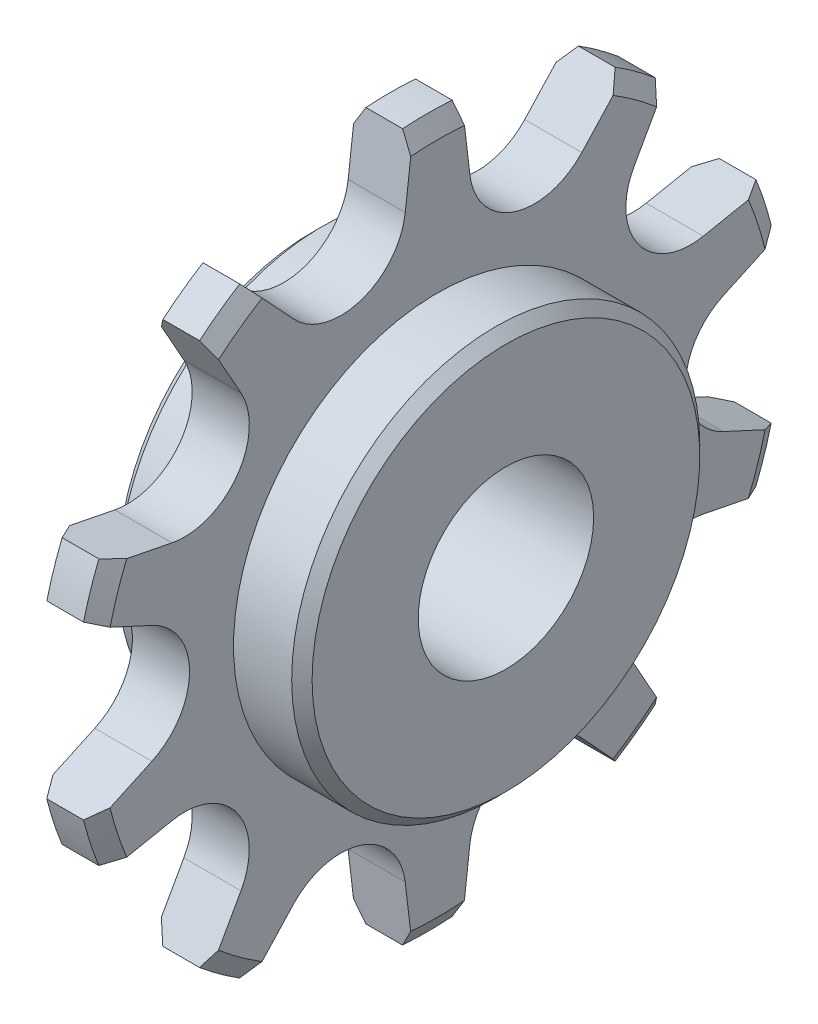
ISO-10303-21;
HEADER;
FILE_DESCRIPTION(('STEP AP214'),'2;1');
FILE_NAME('part.step','',(''),(''),'','','');
FILE_SCHEMA(('AUTOMOTIVE_DESIGN { 1 0 10303 214 1 1 1 1 }'));
ENDSEC;
DATA;
#1=APPLICATION_CONTEXT('core data for automotive mechanical design processes');
#2=APPLICATION_PROTOCOL_DEFINITION('international standard','automotive_design',2000,#1);
#3=PRODUCT_CONTEXT('',#1,'mechanical');
#4=PRODUCT('Part','Part','',(#3));
#5=PRODUCT_RELATED_PRODUCT_CATEGORY('part','',(#4));
#6=PRODUCT_DEFINITION_FORMATION('','',#4);
#7=PRODUCT_DEFINITION_CONTEXT('part definition',#1,'design');
#8=PRODUCT_DEFINITION('design','',#6,#7);
#9=PRODUCT_DEFINITION_SHAPE('','',#8);
#10=(LENGTH_UNIT() NAMED_UNIT(*) SI_UNIT(.MILLI.,.METRE.));
#11=(NAMED_UNIT(*) PLANE_ANGLE_UNIT() SI_UNIT($,.RADIAN.));
#12=(NAMED_UNIT(*) SI_UNIT($,.STERADIAN.) SOLID_ANGLE_UNIT());
#13=UNCERTAINTY_MEASURE_WITH_UNIT(LENGTH_MEASURE(1.E-05),#10,'distance_accuracy_value','');
#14=(GEOMETRIC_REPRESENTATION_CONTEXT(3) GLOBAL_UNCERTAINTY_ASSIGNED_CONTEXT((#13)) GLOBAL_UNIT_ASSIGNED_CONTEXT((#10,
#11,#12)) REPRESENTATION_CONTEXT('',''));
#15=CARTESIAN_POINT('',(0.,0.,0.));
#16=DIRECTION('',(0.,0.,1.));
#17=DIRECTION('',(1.,0.,0.));
#18=AXIS2_PLACEMENT_3D('',#15,#16,#17);
#19=CARTESIAN_POINT('',(-4.75,0.,6.90000000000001));
#20=DIRECTION('',(-1.,0.,0.));
#21=DIRECTION('',(0.,0.,1.));
#22=AXIS2_PLACEMENT_3D('',#19,#20,#21);
#23=PLANE('',#22);
#24=CARTESIAN_POINT('',(-4.75,0.,0.));
#25=DIRECTION('',(1.,0.,0.));
#26=DIRECTION('',(0.,0.,-1.));
#27=AXIS2_PLACEMENT_3D('',#24,#25,#26);
#28=CIRCLE('',#27,4.3);
#29=CARTESIAN_POINT('',(-4.75,0.,-4.3));
#30=VERTEX_POINT('',#29);
#31=EDGE_CURVE('E366',#30,#30,#28,.T.);
#32=ORIENTED_EDGE('',*,*,#31,.T.);
#33=EDGE_LOOP('',(#32));
#34=FACE_BOUND('',#33,.T.);
#35=CARTESIAN_POINT('',(-4.75000000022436,0.,0.));
#36=DIRECTION('',(1.,0.,0.));
#37=DIRECTION('',(0.,0.,-1.));
#38=AXIS2_PLACEMENT_3D('',#35,#36,#37);
#39=CIRCLE('',#38,9.50000000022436);
#40=CARTESIAN_POINT('',(-4.75000000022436,0.,-9.50000000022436));
#41=VERTEX_POINT('',#40);
#42=EDGE_CURVE('E19',#41,#41,#39,.T.);
#43=ORIENTED_EDGE('',*,*,#42,.F.);
#44=EDGE_LOOP('',(#43));
#45=FACE_BOUND('',#44,.T.);
#46=ADVANCED_FACE('F16',(#34,#45),#23,.T.);
#47=CARTESIAN_POINT('',(-4.24999999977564,0.,0.));
#48=DIRECTION('',(1.,0.,0.));
#49=DIRECTION('',(0.,0.,-1.));
#50=AXIS2_PLACEMENT_3D('',#47,#48,#49);
#51=CONICAL_SURFACE('',#50,9.99999999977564,0.7853981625);
#52=ORIENTED_EDGE('',*,*,#42,.T.);
#53=EDGE_LOOP('',(#52));
#54=FACE_BOUND('',#53,.T.);
#55=CARTESIAN_POINT('',(-4.25,0.,0.));
#56=DIRECTION('',(1.,0.,0.));
#57=DIRECTION('',(0.,0.,-1.));
#58=AXIS2_PLACEMENT_3D('',#55,#56,#57);
#59=CIRCLE('',#58,10.);
#60=CARTESIAN_POINT('',(-4.25,0.,-10.));
#61=VERTEX_POINT('',#60);
#62=EDGE_CURVE('E556',#61,#61,#59,.T.);
#63=ORIENTED_EDGE('',*,*,#62,.F.);
#64=EDGE_LOOP('',(#63));
#65=FACE_BOUND('',#64,.T.);
#66=ADVANCED_FACE('F1495',(#54,#65),#51,.T.);
#67=CARTESIAN_POINT('',(0.,0.,0.));
#68=DIRECTION('',(1.,0.,0.));
#69=DIRECTION('',(0.,0.,-1.));
#70=AXIS2_PLACEMENT_3D('',#67,#68,#69);
#71=CYLINDRICAL_SURFACE('',#70,4.3);
#72=CARTESIAN_POINT('',(4.75,0.,0.));
#73=DIRECTION('',(1.,0.,0.));
#74=DIRECTION('',(0.,0.,-1.));
#75=AXIS2_PLACEMENT_3D('',#72,#73,#74);
#76=CIRCLE('',#75,4.3);
#77=CARTESIAN_POINT('',(4.75,0.,-4.3));
#78=VERTEX_POINT('',#77);
#79=EDGE_CURVE('E543',#78,#78,#76,.F.);
#80=ORIENTED_EDGE('',*,*,#79,.F.);
#81=EDGE_LOOP('',(#80));
#82=FACE_BOUND('',#81,.T.);
#83=ORIENTED_EDGE('',*,*,#31,.F.);
#84=EDGE_LOOP('',(#83));
#85=FACE_BOUND('',#84,.T.);
#86=ADVANCED_FACE('F1489',(#82,#85),#71,.F.);
#87=CARTESIAN_POINT('',(-0.899999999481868,0.,0.));
#88=DIRECTION('',(1.,0.,0.));
#89=DIRECTION('',(0.,1.,0.));
#90=AXIS2_PLACEMENT_3D('',#87,#88,#89);
#91=CONICAL_SURFACE('',#90,17.3660254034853,1.04719755);
#92=CARTESIAN_POINT('',(-1.40000000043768,-3.83125398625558,-16.0490340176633));
#93=CARTESIAN_POINT('',(-1.31672826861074,-3.89289560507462,-16.1825986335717));
#94=CARTESIAN_POINT('',(-1.2334257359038,-3.9545299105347,-16.3161474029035));
#95=CARTESIAN_POINT('',(-1.06675906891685,-4.07778389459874,-16.5832132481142));
#96=CARTESIAN_POINT('',(-0.983394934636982,-4.13940357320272,-16.7167303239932));
#97=CARTESIAN_POINT('',(-0.899999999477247,-4.20101593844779,-16.8502315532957));
#98=B_SPLINE_CURVE_WITH_KNOTS('',3,(#92,#93,#94,#95,#96,#97),.UNSPECIFIED.,.F.,.F.,(4,2,4),(0.,
0.507109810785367,1.0142196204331),.UNSPECIFIED.);
#99=CARTESIAN_POINT('',(-1.40000000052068,-3.83125398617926,-16.0490340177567));
#100=VERTEX_POINT('',#99);
#101=CARTESIAN_POINT('',(-0.899999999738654,-4.20101593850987,-16.8502315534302));
#102=VERTEX_POINT('',#101);
#103=EDGE_CURVE('E365',#100,#102,#98,.T.);
#104=ORIENTED_EDGE('',*,*,#103,.T.);
#105=CARTESIAN_POINT('',(-0.900000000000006,0.,0.));
#106=DIRECTION('',(1.,0.,0.));
#107=DIRECTION('',(0.,0.,-1.));
#108=AXIS2_PLACEMENT_3D('',#105,#106,#107);
#109=CIRCLE('',#108,17.3660254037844);
#110=CARTESIAN_POINT('',(-0.899999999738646,-6.51042400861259,-16.0994787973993));
#111=VERTEX_POINT('',#110);
#112=EDGE_CURVE('E363',#111,#102,#109,.T.);
#113=ORIENTED_EDGE('',*,*,#112,.F.);
#114=CARTESIAN_POINT('',(-0.89999999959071,-6.51042400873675,-16.0994787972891));
#115=CARTESIAN_POINT('',(-0.983395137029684,-6.4817977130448,-15.9552506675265));
#116=CARTESIAN_POINT('',(-1.06675937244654,-6.45316800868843,-15.8110053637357));
#117=CARTESIAN_POINT('',(-1.23342603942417,-6.39590178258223,-15.5224804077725));
#118=CARTESIAN_POINT('',(-1.31672847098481,-6.36726526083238,-15.3782007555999));
#119=CARTESIAN_POINT('',(-1.40000000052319,-6.33862533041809,-15.2339039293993));
#120=B_SPLINE_CURVE_WITH_KNOTS('',3,(#114,#115,#116,#117,#118,#119),.UNSPECIFIED.,.F.,.F.,(4,2,
4),(0.,0.507132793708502,1.01426558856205),.UNSPECIFIED.);
#121=CARTESIAN_POINT('',(-1.40000000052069,-6.33862533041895,-15.2339039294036));
#122=VERTEX_POINT('',#121);
#123=EDGE_CURVE('E354',#111,#122,#120,.T.);
#124=ORIENTED_EDGE('',*,*,#123,.T.);
#125=CARTESIAN_POINT('',(-1.40000000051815,0.,0.));
#126=DIRECTION('',(1.,0.,0.));
#127=DIRECTION('',(0.,1.,0.));
#128=AXIS2_PLACEMENT_3D('',#125,#126,#127);
#129=CIRCLE('',#128,16.5000000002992);
#130=EDGE_CURVE('E360',#100,#122,#129,.F.);
#131=ORIENTED_EDGE('',*,*,#130,.F.);
#132=EDGE_LOOP('',(#104,#113,#124,#131));
#133=FACE_BOUND('',#132,.T.);
#134=ADVANCED_FACE('F359',(#133),#91,.T.);
#135=CARTESIAN_POINT('',(-0.899999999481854,0.,0.));
#136=DIRECTION('',(1.,0.,0.));
#137=DIRECTION('',(0.,1.,0.));
#138=AXIS2_PLACEMENT_3D('',#135,#136,#137);
#139=CONICAL_SURFACE('',#138,17.3660254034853,1.04719755);
#140=CARTESIAN_POINT('',(-1.40000000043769,-12.5329350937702,-10.7319866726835));
#141=CARTESIAN_POINT('',(-1.31672826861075,-12.6613115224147,-10.8038106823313));
#142=CARTESIAN_POINT('',(-1.2334257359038,-12.7896727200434,-10.8756261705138));
#143=CARTESIAN_POINT('',(-1.06675906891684,-13.0463646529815,-11.0192401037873));
#144=CARTESIAN_POINT('',(-0.983394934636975,-13.174695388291,-11.0910385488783));
#145=CARTESIAN_POINT('',(-0.89999999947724,-13.3030108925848,-11.162828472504));
#146=B_SPLINE_CURVE_WITH_KNOTS('',3,(#140,#141,#142,#143,#144,#145),.UNSPECIFIED.,.F.,.F.,(4,2,
4),(0.,0.50710981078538,1.01421962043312),.UNSPECIFIED.);
#147=CARTESIAN_POINT('',(-1.40000000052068,-12.5329350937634,-10.7319866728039));
#148=VERTEX_POINT('',#147);
#149=CARTESIAN_POINT('',(-0.89999999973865,-13.3030108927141,-11.1628284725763));
#150=VERTEX_POINT('',#149);
#151=EDGE_CURVE('E1130',#148,#150,#146,.T.);
#152=ORIENTED_EDGE('',*,*,#151,.T.);
#153=CARTESIAN_POINT('',(-0.900000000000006,0.,0.));
#154=DIRECTION('',(1.,0.,0.));
#155=DIRECTION('',(0.,0.,-1.));
#156=AXIS2_PLACEMENT_3D('',#153,#154,#155);
#157=CIRCLE('',#156,17.3660254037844);
#158=CARTESIAN_POINT('',(-0.899999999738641,-14.7300798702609,-9.19802072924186));
#159=VERTEX_POINT('',#158);
#160=EDGE_CURVE('E400',#159,#150,#157,.T.);
#161=ORIENTED_EDGE('',*,*,#160,.F.);
#162=CARTESIAN_POINT('',(-0.899999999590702,-14.7300798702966,-9.19802072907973));
#163=CARTESIAN_POINT('',(-0.983395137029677,-14.6221455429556,-9.09816383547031));
#164=CARTESIAN_POINT('',(-1.06675937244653,-14.5141983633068,-8.99829505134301));
#165=CARTESIAN_POINT('',(-1.23342603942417,-14.2982782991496,-8.79853370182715));
#166=CARTESIAN_POINT('',(-1.31672847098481,-14.1903054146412,-8.69864113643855));
#167=CARTESIAN_POINT('',(-1.40000000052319,-14.082319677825,-8.59873668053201));
#168=B_SPLINE_CURVE_WITH_KNOTS('',3,(#162,#163,#164,#165,#166,#167),.UNSPECIFIED.,.F.,.F.,(4,2,
4),(0.,0.507132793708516,1.01426558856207),.UNSPECIFIED.);
#169=CARTESIAN_POINT('',(-1.40000000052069,-14.0823196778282,-8.59873668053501));
#170=VERTEX_POINT('',#169);
#171=EDGE_CURVE('E905',#159,#170,#168,.T.);
#172=ORIENTED_EDGE('',*,*,#171,.T.);
#173=CARTESIAN_POINT('',(-1.40000000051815,0.,0.));
#174=DIRECTION('',(1.,0.,0.));
#175=DIRECTION('',(0.,1.,0.));
#176=AXIS2_PLACEMENT_3D('',#173,#174,#175);
#177=CIRCLE('',#176,16.5000000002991);
#178=EDGE_CURVE('E374',#148,#170,#177,.F.);
#179=ORIENTED_EDGE('',*,*,#178,.F.);
#180=EDGE_LOOP('',(#152,#161,#172,#179));
#181=FACE_BOUND('',#180,.T.);
#182=ADVANCED_FACE('F1146',(#181),#139,.T.);
#183=CARTESIAN_POINT('',(-0.899999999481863,0.,0.));
#184=DIRECTION('',(1.,0.,0.));
#185=DIRECTION('',(0.,1.,0.));
#186=AXIS2_PLACEMENT_3D('',#183,#184,#185);
#187=CONICAL_SURFACE('',#186,17.3660254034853,1.04719755);
#188=CARTESIAN_POINT('',(-1.40000000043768,-16.447460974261,-1.31568518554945));
#189=CARTESIAN_POINT('',(-1.31672826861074,-16.593536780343,-1.29833425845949));
#190=CARTESIAN_POINT('',(-1.2334257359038,-16.7395952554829,-1.28098538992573));
#191=CARTESIAN_POINT('',(-1.06675906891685,-17.0316775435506,-1.24629177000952));
#192=CARTESIAN_POINT('',(-0.983394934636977,-17.1777013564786,-1.22894701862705));
#193=CARTESIAN_POINT('',(-0.899999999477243,-17.3237078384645,-1.21160432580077));
#194=B_SPLINE_CURVE_WITH_KNOTS('',3,(#188,#189,#190,#191,#192,#193),.UNSPECIFIED.,.F.,.F.,(4,2,
4),(0.,0.507109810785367,1.0142196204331),.UNSPECIFIED.);
#195=CARTESIAN_POINT('',(-1.40000000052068,-16.4474609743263,-1.31568518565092));
#196=VERTEX_POINT('',#195);
#197=CARTESIAN_POINT('',(-0.899999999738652,-17.3237078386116,-1.2116043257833));
#198=VERTEX_POINT('',#197);
#199=EDGE_CURVE('E1091',#196,#198,#194,.T.);
#200=ORIENTED_EDGE('',*,*,#199,.T.);
#201=CARTESIAN_POINT('',(-0.900000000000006,0.,0.));
#202=DIRECTION('',(1.,0.,0.));
#203=DIRECTION('',(0.,0.,-1.));
#204=AXIS2_PLACEMENT_3D('',#201,#202,#203);
#205=CIRCLE('',#204,17.3660254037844);
#206=CARTESIAN_POINT('',(-0.899999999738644,-17.3233458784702,1.21676862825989));
#207=VERTEX_POINT('',#206);
#208=EDGE_CURVE('E403',#207,#198,#205,.T.);
#209=ORIENTED_EDGE('',*,*,#208,.F.);
#210=CARTESIAN_POINT('',(-0.899999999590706,-17.3233458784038,1.21676862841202));
#211=CARTESIAN_POINT('',(-0.983395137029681,-17.1773307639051,1.23411234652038));
#212=CARTESIAN_POINT('',(-1.06675937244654,-17.0312982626,1.25145812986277));
#213=CARTESIAN_POINT('',(-1.23342603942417,-16.7391984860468,1.28615382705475));
#214=CARTESIAN_POINT('',(-1.31672847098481,-16.5931312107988,1.30350374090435));
#215=CARTESIAN_POINT('',(-1.40000000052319,-16.4470465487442,1.32085571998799));
#216=B_SPLINE_CURVE_WITH_KNOTS('',3,(#210,#211,#212,#213,#214,#215),.UNSPECIFIED.,.F.,.F.,(4,2,
4),(0.,0.507132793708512,1.01426558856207),.UNSPECIFIED.);
#217=CARTESIAN_POINT('',(-1.40000000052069,-16.4470465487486,1.32085571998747));
#218=VERTEX_POINT('',#217);
#219=EDGE_CURVE('E1123',#207,#218,#216,.T.);
#220=ORIENTED_EDGE('',*,*,#219,.T.);
#221=CARTESIAN_POINT('',(-1.40000000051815,0.,0.));
#222=DIRECTION('',(1.,0.,0.));
#223=DIRECTION('',(0.,1.,0.));
#224=AXIS2_PLACEMENT_3D('',#221,#222,#223);
#225=CIRCLE('',#224,16.5000000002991);
#226=EDGE_CURVE('E894',#196,#218,#225,.F.);
#227=ORIENTED_EDGE('',*,*,#226,.F.);
#228=EDGE_LOOP('',(#200,#209,#220,#227));
#229=FACE_BOUND('',#228,.T.);
#230=ADVANCED_FACE('F1141',(#229),#187,.T.);
#231=CARTESIAN_POINT('',(-0.899999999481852,0.,0.));
#232=DIRECTION('',(1.,0.,0.));
#233=DIRECTION('',(0.,1.,0.));
#234=AXIS2_PLACEMENT_3D('',#231,#232,#233);
#235=CONICAL_SURFACE('',#234,17.3660254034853,1.04719755);
#236=CARTESIAN_POINT('',(-1.40000000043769,-14.0796157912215,8.60316332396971));
#237=CARTESIAN_POINT('',(-1.31672826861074,-14.1875949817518,8.70306172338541));
#238=CARTESIAN_POINT('',(-1.2334257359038,-14.2955613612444,8.80294827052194));
#239=CARTESIAN_POINT('',(-1.06675906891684,-14.5114684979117,9.00269766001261));
#240=CARTESIAN_POINT('',(-0.98339493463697,-14.6194092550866,9.10256050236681));
#241=CARTESIAN_POINT('',(-0.899999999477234,-14.7273372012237,9.20241149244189));
#242=B_SPLINE_CURVE_WITH_KNOTS('',3,(#236,#237,#238,#239,#240,#241),.UNSPECIFIED.,.F.,.F.,(4,2,
4),(0.,0.50710981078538,1.01421962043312),.UNSPECIFIED.);
#243=CARTESIAN_POINT('',(-1.40000000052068,-14.079615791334,8.603163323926));
#244=VERTEX_POINT('',#243);
#245=CARTESIAN_POINT('',(-0.899999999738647,-14.7273372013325,9.2024114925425));
#246=VERTEX_POINT('',#245);
#247=EDGE_CURVE('E1638',#244,#246,#242,.T.);
#248=ORIENTED_EDGE('',*,*,#247,.T.);
#249=CARTESIAN_POINT('',(-0.900000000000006,0.,0.));
#250=DIRECTION('',(1.,0.,0.));
#251=DIRECTION('',(0.,0.,-1.));
#252=AXIS2_PLACEMENT_3D('',#249,#250,#251);
#253=CIRCLE('',#252,17.3660254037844);
#254=CARTESIAN_POINT('',(-0.899999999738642,-13.2996825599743,11.166793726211));
#255=VERTEX_POINT('',#254);
#256=EDGE_CURVE('E423',#255,#246,#253,.T.);
#257=ORIENTED_EDGE('',*,*,#256,.F.);
#258=CARTESIAN_POINT('',(-0.899999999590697,-13.2996825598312,11.166793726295));
#259=CARTESIAN_POINT('',(-0.983395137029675,-13.1713594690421,11.0949995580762));
#260=CARTESIAN_POINT('',(-1.06675937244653,-13.043021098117,11.0231968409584));
#261=CARTESIAN_POINT('',(-1.23342603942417,-12.786313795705,10.8795743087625));
#262=CARTESIAN_POINT('',(-1.31672847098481,-12.6579448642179,10.8077544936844));
#263=CARTESIAN_POINT('',(-1.40000000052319,-12.5295606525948,10.7359261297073));
#264=B_SPLINE_CURVE_WITH_KNOTS('',3,(#258,#259,#260,#261,#262,#263),.UNSPECIFIED.,.F.,.F.,(4,2,
4),(0.,0.507132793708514,1.01426558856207),.UNSPECIFIED.);
#265=CARTESIAN_POINT('',(-1.40000000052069,-12.5295606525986,10.7359261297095));
#266=VERTEX_POINT('',#265);
#267=EDGE_CURVE('E1640',#255,#266,#264,.T.);
#268=ORIENTED_EDGE('',*,*,#267,.T.);
#269=CARTESIAN_POINT('',(-1.40000000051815,0.,0.));
#270=DIRECTION('',(1.,0.,0.));
#271=DIRECTION('',(0.,1.,0.));
#272=AXIS2_PLACEMENT_3D('',#269,#270,#271);
#273=CIRCLE('',#272,16.5000000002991);
#274=EDGE_CURVE('E891',#244,#266,#273,.F.);
#275=ORIENTED_EDGE('',*,*,#274,.F.);
#276=EDGE_LOOP('',(#248,#257,#268,#275));
#277=FACE_BOUND('',#276,.T.);
#278=ADVANCED_FACE('F1145',(#277),#235,.T.);
#279=CARTESIAN_POINT('',(-0.899999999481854,0.,0.));
#280=DIRECTION('',(1.,0.,0.));
#281=DIRECTION('',(0.,1.,0.));
#282=AXIS2_PLACEMENT_3D('',#279,#280,#281);
#283=CONICAL_SURFACE('',#282,17.3660254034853,1.04719755);
#284=CARTESIAN_POINT('',(-1.40000000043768,-6.3338359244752,15.235895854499));
#285=CARTESIAN_POINT('',(-1.31672826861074,-6.3624741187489,15.3801839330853));
#286=CARTESIAN_POINT('',(-1.23342573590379,-6.39110891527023,15.5244548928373));
#287=CARTESIAN_POINT('',(-1.06675906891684,-6.4483717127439,15.8129625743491));
#288=CARTESIAN_POINT('',(-0.983394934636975,-6.47699971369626,15.9571992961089));
#289=CARTESIAN_POINT('',(-0.89999999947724,-6.50562431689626,16.1014188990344));
#290=B_SPLINE_CURVE_WITH_KNOTS('',3,(#284,#285,#286,#287,#288,#289),.UNSPECIFIED.,.F.,.F.,(4,2,
4),(0.,0.507109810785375,1.01421962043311),.UNSPECIFIED.);
#291=CARTESIAN_POINT('',(-1.40000000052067,-6.33383592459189,15.2358958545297));
#292=VERTEX_POINT('',#291);
#293=CARTESIAN_POINT('',(-0.89999999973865,-6.5056243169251,16.1014188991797));
#294=VERTEX_POINT('',#293);
#295=EDGE_CURVE('E1642',#292,#294,#290,.T.);
#296=ORIENTED_EDGE('',*,*,#295,.T.);
#297=CARTESIAN_POINT('',(-0.900000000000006,0.,0.));
#298=DIRECTION('',(1.,0.,0.));
#299=DIRECTION('',(0.,0.,-1.));
#300=AXIS2_PLACEMENT_3D('',#297,#298,#299);
#301=CIRCLE('',#300,17.3660254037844);
#302=CARTESIAN_POINT('',(-0.899999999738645,-4.19599254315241,16.8514831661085));
#303=VERTEX_POINT('',#302);
#304=EDGE_CURVE('E443',#303,#294,#301,.T.);
#305=ORIENTED_EDGE('',*,*,#304,.F.);
#306=CARTESIAN_POINT('',(-0.899999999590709,-4.1959925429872,16.8514831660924));
#307=CARTESIAN_POINT('',(-0.983395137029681,-4.13437653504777,16.7179740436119));
#308=CARTESIAN_POINT('',(-1.06675937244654,-4.07275319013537,16.5844490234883));
#309=CARTESIAN_POINT('',(-1.23342603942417,-3.9494918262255,16.3173671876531));
#310=CARTESIAN_POINT('',(-1.3167284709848,-3.88785380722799,16.1838103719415));
#311=CARTESIAN_POINT('',(-1.40000000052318,-3.82620845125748,16.0502376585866));
#312=B_SPLINE_CURVE_WITH_KNOTS('',3,(#306,#307,#308,#309,#310,#311),.UNSPECIFIED.,.F.,.F.,(4,2,
4),(0.,0.507132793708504,1.01426558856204),.UNSPECIFIED.);
#313=CARTESIAN_POINT('',(-1.40000000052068,-3.82620845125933,16.0502376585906));
#314=VERTEX_POINT('',#313);
#315=EDGE_CURVE('E1639',#303,#314,#312,.T.);
#316=ORIENTED_EDGE('',*,*,#315,.T.);
#317=CARTESIAN_POINT('',(-1.40000000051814,0.,0.));
#318=DIRECTION('',(1.,0.,0.));
#319=DIRECTION('',(0.,1.,0.));
#320=AXIS2_PLACEMENT_3D('',#317,#318,#319);
#321=CIRCLE('',#320,16.5000000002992);
#322=EDGE_CURVE('E888',#292,#314,#321,.F.);
#323=ORIENTED_EDGE('',*,*,#322,.F.);
#324=EDGE_LOOP('',(#296,#305,#316,#323));
#325=FACE_BOUND('',#324,.T.);
#326=ADVANCED_FACE('F1461',(#325),#283,.T.);
#327=CARTESIAN_POINT('',(-0.899999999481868,0.,0.));
#328=DIRECTION('',(1.,0.,0.));
#329=DIRECTION('',(0.,1.,0.));
#330=AXIS2_PLACEMENT_3D('',#327,#328,#329);
#331=CONICAL_SURFACE('',#330,17.3660254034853,1.04719755);
#332=CARTESIAN_POINT('',(-1.4000000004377,3.83125398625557,16.0490340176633));
#333=CARTESIAN_POINT('',(-1.31672826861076,3.89289560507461,16.1825986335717));
#334=CARTESIAN_POINT('',(-1.23342573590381,3.9545299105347,16.3161474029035));
#335=CARTESIAN_POINT('',(-1.06675906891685,4.07778389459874,16.5832132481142));
#336=CARTESIAN_POINT('',(-0.983394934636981,4.13940357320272,16.7167303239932));
#337=CARTESIAN_POINT('',(-0.899999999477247,4.20101593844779,16.8502315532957));
#338=B_SPLINE_CURVE_WITH_KNOTS('',3,(#332,#333,#334,#335,#336,#337),.UNSPECIFIED.,.F.,.F.,(4,2,
4),(0.,0.507109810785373,1.01421962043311),.UNSPECIFIED.);
#339=CARTESIAN_POINT('',(-1.40000000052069,3.83125398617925,16.0490340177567));
#340=VERTEX_POINT('',#339);
#341=CARTESIAN_POINT('',(-0.899999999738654,4.20101593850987,16.8502315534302));
#342=VERTEX_POINT('',#341);
#343=EDGE_CURVE('E1687',#340,#342,#338,.T.);
#344=ORIENTED_EDGE('',*,*,#343,.T.);
#345=CARTESIAN_POINT('',(-0.900000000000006,0.,0.));
#346=DIRECTION('',(1.,0.,0.));
#347=DIRECTION('',(0.,0.,-1.));
#348=AXIS2_PLACEMENT_3D('',#345,#346,#347);
#349=CIRCLE('',#348,17.3660254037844);
#350=CARTESIAN_POINT('',(-0.899999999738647,6.51042400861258,16.0994787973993));
#351=VERTEX_POINT('',#350);
#352=EDGE_CURVE('E463',#351,#342,#349,.T.);
#353=ORIENTED_EDGE('',*,*,#352,.F.);
#354=CARTESIAN_POINT('',(-0.899999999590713,6.51042400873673,16.0994787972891));
#355=CARTESIAN_POINT('',(-0.983395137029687,6.48179771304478,15.9552506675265));
#356=CARTESIAN_POINT('',(-1.06675937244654,6.45316800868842,15.8110053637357));
#357=CARTESIAN_POINT('',(-1.23342603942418,6.39590178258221,15.5224804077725));
#358=CARTESIAN_POINT('',(-1.31672847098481,6.36726526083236,15.3782007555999));
#359=CARTESIAN_POINT('',(-1.4000000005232,6.33862533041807,15.2339039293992));
#360=B_SPLINE_CURVE_WITH_KNOTS('',3,(#354,#355,#356,#357,#358,#359),.UNSPECIFIED.,.F.,.F.,(4,2,
4),(0.,0.507132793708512,1.01426558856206),.UNSPECIFIED.);
#361=CARTESIAN_POINT('',(-1.4000000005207,6.33862533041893,15.2339039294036));
#362=VERTEX_POINT('',#361);
#363=EDGE_CURVE('E1677',#351,#362,#360,.T.);
#364=ORIENTED_EDGE('',*,*,#363,.T.);
#365=CARTESIAN_POINT('',(-1.40000000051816,0.,0.));
#366=DIRECTION('',(1.,0.,0.));
#367=DIRECTION('',(0.,1.,0.));
#368=AXIS2_PLACEMENT_3D('',#365,#366,#367);
#369=CIRCLE('',#368,16.5000000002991);
#370=EDGE_CURVE('E885',#340,#362,#369,.F.);
#371=ORIENTED_EDGE('',*,*,#370,.F.);
#372=EDGE_LOOP('',(#344,#353,#364,#371));
#373=FACE_BOUND('',#372,.T.);
#374=ADVANCED_FACE('F1454',(#373),#331,.T.);
#375=CARTESIAN_POINT('',(-0.89999999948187,0.,0.));
#376=DIRECTION('',(1.,0.,0.));
#377=DIRECTION('',(0.,1.,0.));
#378=AXIS2_PLACEMENT_3D('',#375,#376,#377);
#379=CONICAL_SURFACE('',#378,17.3660254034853,1.04719755);
#380=CARTESIAN_POINT('',(-1.4000000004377,12.5329350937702,10.7319866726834));
#381=CARTESIAN_POINT('',(-1.31672826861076,12.6613115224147,10.8038106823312));
#382=CARTESIAN_POINT('',(-1.23342573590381,12.7896727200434,10.8756261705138));
#383=CARTESIAN_POINT('',(-1.06675906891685,13.0463646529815,11.0192401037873));
#384=CARTESIAN_POINT('',(-0.983394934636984,13.174695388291,11.0910385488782));
#385=CARTESIAN_POINT('',(-0.899999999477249,13.3030108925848,11.1628284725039));
#386=B_SPLINE_CURVE_WITH_KNOTS('',3,(#380,#381,#382,#383,#384,#385),.UNSPECIFIED.,.F.,.F.,(4,2,
4),(0.,0.507109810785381,1.01421962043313),.UNSPECIFIED.);
#387=CARTESIAN_POINT('',(-1.40000000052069,12.5329350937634,10.7319866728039));
#388=VERTEX_POINT('',#387);
#389=CARTESIAN_POINT('',(-0.899999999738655,13.3030108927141,11.1628284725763));
#390=VERTEX_POINT('',#389);
#391=EDGE_CURVE('E1717',#388,#390,#386,.T.);
#392=ORIENTED_EDGE('',*,*,#391,.T.);
#393=CARTESIAN_POINT('',(-0.900000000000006,0.,0.));
#394=DIRECTION('',(1.,0.,0.));
#395=DIRECTION('',(0.,0.,-1.));
#396=AXIS2_PLACEMENT_3D('',#393,#394,#395);
#397=CIRCLE('',#396,17.3660254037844);
#398=CARTESIAN_POINT('',(-0.89999999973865,14.7300798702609,9.19802072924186));
#399=VERTEX_POINT('',#398);
#400=EDGE_CURVE('E483',#399,#390,#397,.T.);
#401=ORIENTED_EDGE('',*,*,#400,.F.);
#402=CARTESIAN_POINT('',(-0.899999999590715,14.7300798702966,9.19802072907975));
#403=CARTESIAN_POINT('',(-0.983395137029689,14.6221455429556,9.09816383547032));
#404=CARTESIAN_POINT('',(-1.06675937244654,14.5141983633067,8.99829505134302));
#405=CARTESIAN_POINT('',(-1.23342603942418,14.2982782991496,8.79853370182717));
#406=CARTESIAN_POINT('',(-1.31672847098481,14.1903054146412,8.69864113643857));
#407=CARTESIAN_POINT('',(-1.40000000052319,14.082319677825,8.59873668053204));
#408=B_SPLINE_CURVE_WITH_KNOTS('',3,(#402,#403,#404,#405,#406,#407),.UNSPECIFIED.,.F.,.F.,(4,2,
4),(0.,0.507132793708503,1.01426558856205),.UNSPECIFIED.);
#409=CARTESIAN_POINT('',(-1.40000000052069,14.0823196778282,8.59873668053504));
#410=VERTEX_POINT('',#409);
#411=EDGE_CURVE('E1692',#399,#410,#408,.T.);
#412=ORIENTED_EDGE('',*,*,#411,.T.);
#413=CARTESIAN_POINT('',(-1.40000000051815,0.,0.));
#414=DIRECTION('',(1.,0.,0.));
#415=DIRECTION('',(0.,1.,0.));
#416=AXIS2_PLACEMENT_3D('',#413,#414,#415);
#417=CIRCLE('',#416,16.5000000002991);
#418=EDGE_CURVE('E882',#388,#410,#417,.F.);
#419=ORIENTED_EDGE('',*,*,#418,.F.);
#420=EDGE_LOOP('',(#392,#401,#412,#419));
#421=FACE_BOUND('',#420,.T.);
#422=ADVANCED_FACE('F1447',(#421),#379,.T.);
#423=CARTESIAN_POINT('',(-0.899999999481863,0.,0.));
#424=DIRECTION('',(1.,0.,0.));
#425=DIRECTION('',(0.,1.,0.));
#426=AXIS2_PLACEMENT_3D('',#423,#424,#425);
#427=CONICAL_SURFACE('',#426,17.3660254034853,1.04719755);
#428=CARTESIAN_POINT('',(-1.4000000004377,16.4474609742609,1.31568518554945));
#429=CARTESIAN_POINT('',(-1.31672826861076,16.593536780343,1.2983342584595));
#430=CARTESIAN_POINT('',(-1.23342573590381,16.7395952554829,1.28098538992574));
#431=CARTESIAN_POINT('',(-1.06675906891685,17.0316775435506,1.24629177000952));
#432=CARTESIAN_POINT('',(-0.983394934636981,17.1777013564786,1.22894701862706));
#433=CARTESIAN_POINT('',(-0.899999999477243,17.3237078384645,1.21160432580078));
#434=B_SPLINE_CURVE_WITH_KNOTS('',3,(#428,#429,#430,#431,#432,#433),.UNSPECIFIED.,.F.,.F.,(4,2,
4),(0.,0.507109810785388,1.01421962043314),.UNSPECIFIED.);
#435=CARTESIAN_POINT('',(-1.40000000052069,16.4474609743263,1.31568518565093));
#436=VERTEX_POINT('',#435);
#437=CARTESIAN_POINT('',(-0.899999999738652,17.3237078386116,1.21160432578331));
#438=VERTEX_POINT('',#437);
#439=EDGE_CURVE('E844',#436,#438,#434,.T.);
#440=ORIENTED_EDGE('',*,*,#439,.T.);
#441=CARTESIAN_POINT('',(-0.900000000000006,0.,0.));
#442=DIRECTION('',(1.,0.,0.));
#443=DIRECTION('',(0.,0.,-1.));
#444=AXIS2_PLACEMENT_3D('',#441,#442,#443);
#445=CIRCLE('',#444,17.3660254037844);
#446=CARTESIAN_POINT('',(-0.899999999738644,17.3233458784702,-1.2167686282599));
#447=VERTEX_POINT('',#446);
#448=EDGE_CURVE('E503',#447,#438,#445,.T.);
#449=ORIENTED_EDGE('',*,*,#448,.F.);
#450=CARTESIAN_POINT('',(-0.899999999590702,17.3233458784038,-1.21676862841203));
#451=CARTESIAN_POINT('',(-0.98339513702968,17.1773307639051,-1.23411234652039));
#452=CARTESIAN_POINT('',(-1.06675937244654,17.0312982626,-1.25145812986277));
#453=CARTESIAN_POINT('',(-1.23342603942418,16.7391984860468,-1.28615382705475));
#454=CARTESIAN_POINT('',(-1.31672847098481,16.5931312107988,-1.30350374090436));
#455=CARTESIAN_POINT('',(-1.40000000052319,16.4470465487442,-1.320855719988));
#456=B_SPLINE_CURVE_WITH_KNOTS('',3,(#450,#451,#452,#453,#454,#455),.UNSPECIFIED.,.F.,.F.,(4,2,
4),(0.,0.507132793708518,1.01426558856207),.UNSPECIFIED.);
#457=CARTESIAN_POINT('',(-1.40000000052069,16.4470465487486,-1.32085571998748));
#458=VERTEX_POINT('',#457);
#459=EDGE_CURVE('E1721',#447,#458,#456,.T.);
#460=ORIENTED_EDGE('',*,*,#459,.T.);
#461=CARTESIAN_POINT('',(-1.40000000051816,0.,0.));
#462=DIRECTION('',(1.,0.,0.));
#463=DIRECTION('',(0.,1.,0.));
#464=AXIS2_PLACEMENT_3D('',#461,#462,#463);
#465=CIRCLE('',#464,16.5000000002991);
#466=EDGE_CURVE('E879',#436,#458,#465,.F.);
#467=ORIENTED_EDGE('',*,*,#466,.F.);
#468=EDGE_LOOP('',(#440,#449,#460,#467));
#469=FACE_BOUND('',#468,.T.);
#470=ADVANCED_FACE('F828',(#469),#427,.T.);
#471=CARTESIAN_POINT('',(-0.899999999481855,0.,0.));
#472=DIRECTION('',(1.,0.,0.));
#473=DIRECTION('',(0.,0.,-1.));
#474=AXIS2_PLACEMENT_3D('',#471,#472,#473);
#475=CONICAL_SURFACE('',#474,17.3660254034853,1.04719755);
#476=CARTESIAN_POINT('',(-1.40000000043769,14.0796157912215,-8.60316332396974));
#477=CARTESIAN_POINT('',(-1.31672826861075,14.1875949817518,-8.70306172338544));
#478=CARTESIAN_POINT('',(-1.2334257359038,14.2955613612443,-8.80294827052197));
#479=CARTESIAN_POINT('',(-1.06675906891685,14.5114684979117,-9.00269766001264));
#480=CARTESIAN_POINT('',(-0.983394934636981,14.6194092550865,-9.10256050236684));
#481=CARTESIAN_POINT('',(-0.899999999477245,14.7273372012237,-9.20241149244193));
#482=B_SPLINE_CURVE_WITH_KNOTS('',3,(#476,#477,#478,#479,#480,#481),.UNSPECIFIED.,.F.,.F.,(4,2,
4),(0.,0.50710981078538,1.01421962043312),.UNSPECIFIED.);
#483=CARTESIAN_POINT('',(-1.40000000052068,14.079615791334,-8.60316332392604));
#484=VERTEX_POINT('',#483);
#485=CARTESIAN_POINT('',(-0.899999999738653,14.7273372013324,-9.20241149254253));
#486=VERTEX_POINT('',#485);
#487=EDGE_CURVE('E560',#484,#486,#482,.T.);
#488=ORIENTED_EDGE('',*,*,#487,.T.);
#489=CARTESIAN_POINT('',(-0.900000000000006,0.,0.));
#490=DIRECTION('',(1.,0.,0.));
#491=DIRECTION('',(0.,0.,-1.));
#492=AXIS2_PLACEMENT_3D('',#489,#490,#491);
#493=CIRCLE('',#492,17.3660254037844);
#494=CARTESIAN_POINT('',(-0.899999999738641,13.2996825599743,-11.166793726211));
#495=VERTEX_POINT('',#494);
#496=EDGE_CURVE('E523',#495,#486,#493,.T.);
#497=ORIENTED_EDGE('',*,*,#496,.F.);
#498=CARTESIAN_POINT('',(-0.899999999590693,13.2996825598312,-11.166793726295));
#499=CARTESIAN_POINT('',(-0.983395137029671,13.1713594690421,-11.0949995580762));
#500=CARTESIAN_POINT('',(-1.06675937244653,13.043021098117,-11.0231968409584));
#501=CARTESIAN_POINT('',(-1.23342603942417,12.786313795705,-10.8795743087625));
#502=CARTESIAN_POINT('',(-1.31672847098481,12.6579448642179,-10.8077544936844));
#503=CARTESIAN_POINT('',(-1.40000000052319,12.5295606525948,-10.7359261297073));
#504=B_SPLINE_CURVE_WITH_KNOTS('',3,(#498,#499,#500,#501,#502,#503),.UNSPECIFIED.,.F.,.F.,(4,2,
4),(0.,0.507132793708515,1.01426558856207),.UNSPECIFIED.);
#505=CARTESIAN_POINT('',(-1.40000000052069,12.5295606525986,-10.7359261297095));
#506=VERTEX_POINT('',#505);
#507=EDGE_CURVE('E838',#495,#506,#504,.T.);
#508=ORIENTED_EDGE('',*,*,#507,.T.);
#509=CARTESIAN_POINT('',(-1.40000000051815,0.,0.));
#510=DIRECTION('',(1.,0.,0.));
#511=DIRECTION('',(0.,0.,-1.));
#512=AXIS2_PLACEMENT_3D('',#509,#510,#511);
#513=CIRCLE('',#512,16.5000000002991);
#514=EDGE_CURVE('E876',#484,#506,#513,.F.);
#515=ORIENTED_EDGE('',*,*,#514,.F.);
#516=EDGE_LOOP('',(#488,#497,#508,#515));
#517=FACE_BOUND('',#516,.T.);
#518=ADVANCED_FACE('F823',(#517),#475,.T.);
#519=CARTESIAN_POINT('',(-2.82499999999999,0.,0.));
#520=DIRECTION('',(1.,0.,0.));
#521=DIRECTION('',(0.,0.,-1.));
#522=AXIS2_PLACEMENT_3D('',#519,#520,#521);
#523=CYLINDRICAL_SURFACE('',#522,10.);
#524=ORIENTED_EDGE('',*,*,#62,.T.);
#525=EDGE_LOOP('',(#524));
#526=FACE_BOUND('',#525,.T.);
#527=CARTESIAN_POINT('',(-1.40000000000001,0.,0.));
#528=DIRECTION('',(1.,0.,0.));
#529=DIRECTION('',(0.,0.,-1.));
#530=AXIS2_PLACEMENT_3D('',#527,#528,#529);
#531=CIRCLE('',#530,10.);
#532=CARTESIAN_POINT('',(-1.40000000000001,0.,-10.));
#533=VERTEX_POINT('',#532);
#534=EDGE_CURVE('E784',#533,#533,#531,.T.);
#535=ORIENTED_EDGE('',*,*,#534,.F.);
#536=EDGE_LOOP('',(#535));
#537=FACE_BOUND('',#536,.T.);
#538=ADVANCED_FACE('F817',(#526,#537),#523,.T.);
#539=CARTESIAN_POINT('',(-0.899999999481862,0.,0.));
#540=DIRECTION('',(1.,0.,0.));
#541=DIRECTION('',(0.,0.,-1.));
#542=AXIS2_PLACEMENT_3D('',#539,#540,#541);
#543=CONICAL_SURFACE('',#542,17.3660254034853,1.04719755);
#544=CARTESIAN_POINT('',(-0.899999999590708,4.1959925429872,-16.8514831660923));
#545=CARTESIAN_POINT('',(-0.983395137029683,4.13437653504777,-16.7179740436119));
#546=CARTESIAN_POINT('',(-1.06675937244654,4.07275319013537,-16.5844490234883));
#547=CARTESIAN_POINT('',(-1.23342603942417,3.9494918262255,-16.3173671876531));
#548=CARTESIAN_POINT('',(-1.31672847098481,3.88785380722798,-16.1838103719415));
#549=CARTESIAN_POINT('',(-1.40000000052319,3.82620845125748,-16.0502376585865));
#550=B_SPLINE_CURVE_WITH_KNOTS('',3,(#544,#545,#546,#547,#548,#549),.UNSPECIFIED.,.F.,.F.,(4,2,
4),(0.,0.507132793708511,1.01426558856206),.UNSPECIFIED.);
#551=CARTESIAN_POINT('',(-0.899999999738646,4.19599254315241,-16.8514831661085));
#552=VERTEX_POINT('',#551);
#553=CARTESIAN_POINT('',(-1.40000000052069,3.82620845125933,-16.0502376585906));
#554=VERTEX_POINT('',#553);
#555=EDGE_CURVE('E801',#552,#554,#550,.T.);
#556=ORIENTED_EDGE('',*,*,#555,.T.);
#557=CARTESIAN_POINT('',(-1.40000000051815,0.,0.));
#558=DIRECTION('',(1.,0.,0.));
#559=DIRECTION('',(0.,0.,-1.));
#560=AXIS2_PLACEMENT_3D('',#557,#558,#559);
#561=CIRCLE('',#560,16.5000000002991);
#562=CARTESIAN_POINT('',(-1.40000000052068,6.33383592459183,-15.2358958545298));
#563=VERTEX_POINT('',#562);
#564=EDGE_CURVE('E375',#563,#554,#561,.F.);
#565=ORIENTED_EDGE('',*,*,#564,.F.);
#566=CARTESIAN_POINT('',(-1.40000000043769,6.33383592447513,-15.235895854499));
#567=CARTESIAN_POINT('',(-1.31672826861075,6.36247411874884,-15.3801839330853));
#568=CARTESIAN_POINT('',(-1.2334257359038,6.39110891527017,-15.5244548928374));
#569=CARTESIAN_POINT('',(-1.06675906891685,6.44837171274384,-15.8129625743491));
#570=CARTESIAN_POINT('',(-0.98339493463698,6.4769997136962,-15.9571992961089));
#571=CARTESIAN_POINT('',(-0.899999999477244,6.5056243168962,-16.1014188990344));
#572=B_SPLINE_CURVE_WITH_KNOTS('',3,(#566,#567,#568,#569,#570,#571),.UNSPECIFIED.,.F.,.F.,(4,2,
4),(0.,0.507109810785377,1.01421962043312),.UNSPECIFIED.);
#573=CARTESIAN_POINT('',(-0.899999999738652,6.50562431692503,-16.1014188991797));
#574=VERTEX_POINT('',#573);
#575=EDGE_CURVE('E559',#563,#574,#572,.T.);
#576=ORIENTED_EDGE('',*,*,#575,.T.);
#577=CARTESIAN_POINT('',(-0.900000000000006,0.,0.));
#578=DIRECTION('',(1.,0.,0.));
#579=DIRECTION('',(0.,0.,-1.));
#580=AXIS2_PLACEMENT_3D('',#577,#578,#579);
#581=CIRCLE('',#580,17.3660254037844);
#582=EDGE_CURVE('E781',#552,#574,#581,.T.);
#583=ORIENTED_EDGE('',*,*,#582,.F.);
#584=EDGE_LOOP('',(#556,#565,#576,#583));
#585=FACE_BOUND('',#584,.T.);
#586=ADVANCED_FACE('F811',(#585),#543,.T.);
#587=CARTESIAN_POINT('',(4.75,0.,6.90000000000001));
#588=DIRECTION('',(1.,0.,0.));
#589=DIRECTION('',(0.,0.,-1.));
#590=AXIS2_PLACEMENT_3D('',#587,#588,#589);
#591=PLANE('',#590);
#592=ORIENTED_EDGE('',*,*,#79,.T.);
#593=EDGE_LOOP('',(#592));
#594=FACE_BOUND('',#593,.T.);
#595=CARTESIAN_POINT('',(4.75000000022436,0.,0.));
#596=DIRECTION('',(-1.,0.,0.));
#597=DIRECTION('',(0.,0.,1.));
#598=AXIS2_PLACEMENT_3D('',#595,#596,#597);
#599=CIRCLE('',#598,9.50000000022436);
#600=CARTESIAN_POINT('',(4.75000000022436,0.,9.50000000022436));
#601=VERTEX_POINT('',#600);
#602=EDGE_CURVE('E555',#601,#601,#599,.T.);
#603=ORIENTED_EDGE('',*,*,#602,.F.);
#604=EDGE_LOOP('',(#603));
#605=FACE_BOUND('',#604,.T.);
#606=ADVANCED_FACE('F816',(#594,#605),#591,.T.);
#607=CARTESIAN_POINT('',(0.,0.,0.));
#608=DIRECTION('',(1.,0.,0.));
#609=DIRECTION('',(0.,0.,-1.));
#610=AXIS2_PLACEMENT_3D('',#607,#608,#609);
#611=CYLINDRICAL_SURFACE('',#610,17.3660254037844);
#612=DIRECTION('',(1.,0.,0.));
#613=VECTOR('',#612,1.);
#614=CARTESIAN_POINT('',(5.25,14.7273372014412,-9.20241149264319));
#615=LINE('',#614,#613);
#616=CARTESIAN_POINT('',(0.899999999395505,14.7273372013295,-9.2024114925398));
#617=VERTEX_POINT('',#616);
#618=EDGE_CURVE('E534',#486,#617,#615,.T.);
#619=ORIENTED_EDGE('',*,*,#618,.T.);
#620=CARTESIAN_POINT('',(0.899999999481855,0.,0.));
#621=DIRECTION('',(-1.,0.,0.));
#622=DIRECTION('',(0.,0.,1.));
#623=AXIS2_PLACEMENT_3D('',#620,#621,#622);
#624=CIRCLE('',#623,17.3660254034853);
#625=CARTESIAN_POINT('',(0.899999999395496,13.2996825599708,-11.166793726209));
#626=VERTEX_POINT('',#625);
#627=EDGE_CURVE('E535',#626,#617,#624,.F.);
#628=ORIENTED_EDGE('',*,*,#627,.F.);
#629=DIRECTION('',(1.,0.,0.));
#630=VECTOR('',#629,1.);
#631=CARTESIAN_POINT('',(5.25,13.2996825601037,-11.1667937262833));
#632=LINE('',#631,#630);
#633=EDGE_CURVE('E544',#626,#495,#632,.F.);
#634=ORIENTED_EDGE('',*,*,#633,.T.);
#635=ORIENTED_EDGE('',*,*,#496,.T.);
#636=EDGE_LOOP('',(#619,#628,#634,#635));
#637=FACE_BOUND('',#636,.T.);
#638=ADVANCED_FACE('F950',(#637),#611,.T.);
#639=CARTESIAN_POINT('',(0.,0.,0.));
#640=DIRECTION('',(1.,0.,0.));
#641=DIRECTION('',(0.,0.,-1.));
#642=AXIS2_PLACEMENT_3D('',#639,#640,#641);
#643=CYLINDRICAL_SURFACE('',#642,17.3660254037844);
#644=DIRECTION('',(1.,0.,0.));
#645=VECTOR('',#644,1.);
#646=CARTESIAN_POINT('',(5.25,17.3237078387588,1.21160432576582));
#647=LINE('',#646,#645);
#648=CARTESIAN_POINT('',(0.899999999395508,17.3237078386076,1.21160432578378));
#649=VERTEX_POINT('',#648);
#650=EDGE_CURVE('E514',#438,#649,#647,.T.);
#651=ORIENTED_EDGE('',*,*,#650,.T.);
#652=CARTESIAN_POINT('',(0.899999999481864,0.,0.));
#653=DIRECTION('',(-1.,0.,0.));
#654=DIRECTION('',(0.,0.,1.));
#655=AXIS2_PLACEMENT_3D('',#652,#653,#654);
#656=CIRCLE('',#655,17.3660254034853);
#657=CARTESIAN_POINT('',(0.899999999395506,17.3233458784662,-1.21676862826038));
#658=VERTEX_POINT('',#657);
#659=EDGE_CURVE('E515',#658,#649,#656,.F.);
#660=ORIENTED_EDGE('',*,*,#659,.F.);
#661=DIRECTION('',(1.,0.,0.));
#662=VECTOR('',#661,1.);
#663=CARTESIAN_POINT('',(5.25,17.3233458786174,-1.21676862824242));
#664=LINE('',#663,#662);
#665=EDGE_CURVE('E524',#658,#447,#664,.F.);
#666=ORIENTED_EDGE('',*,*,#665,.T.);
#667=ORIENTED_EDGE('',*,*,#448,.T.);
#668=EDGE_LOOP('',(#651,#660,#666,#667));
#669=FACE_BOUND('',#668,.T.);
#670=ADVANCED_FACE('F1409',(#669),#643,.T.);
#671=CARTESIAN_POINT('',(0.,0.,0.));
#672=DIRECTION('',(1.,0.,0.));
#673=DIRECTION('',(0.,0.,-1.));
#674=AXIS2_PLACEMENT_3D('',#671,#672,#673);
#675=CYLINDRICAL_SURFACE('',#674,17.3660254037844);
#676=DIRECTION('',(1.,0.,0.));
#677=VECTOR('',#676,1.);
#678=CARTESIAN_POINT('',(5.25,13.3030108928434,11.1628284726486));
#679=LINE('',#678,#677);
#680=CARTESIAN_POINT('',(0.899999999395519,13.3030108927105,11.1628284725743));
#681=VERTEX_POINT('',#680);
#682=EDGE_CURVE('E494',#390,#681,#679,.T.);
#683=ORIENTED_EDGE('',*,*,#682,.T.);
#684=CARTESIAN_POINT('',(0.899999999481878,0.,0.));
#685=DIRECTION('',(-1.,0.,0.));
#686=DIRECTION('',(0.,0.,1.));
#687=AXIS2_PLACEMENT_3D('',#684,#685,#686);
#688=CIRCLE('',#687,17.3660254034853);
#689=CARTESIAN_POINT('',(0.899999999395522,14.7300798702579,9.19802072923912));
#690=VERTEX_POINT('',#689);
#691=EDGE_CURVE('E495',#690,#681,#688,.F.);
#692=ORIENTED_EDGE('',*,*,#691,.F.);
#693=DIRECTION('',(1.,0.,0.));
#694=VECTOR('',#693,1.);
#695=CARTESIAN_POINT('',(5.25,14.7300798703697,9.19802072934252));
#696=LINE('',#695,#694);
#697=EDGE_CURVE('E504',#690,#399,#696,.F.);
#698=ORIENTED_EDGE('',*,*,#697,.T.);
#699=ORIENTED_EDGE('',*,*,#400,.T.);
#700=EDGE_LOOP('',(#683,#692,#698,#699));
#701=FACE_BOUND('',#700,.T.);
#702=ADVANCED_FACE('F1401',(#701),#675,.T.);
#703=CARTESIAN_POINT('',(0.,0.,0.));
#704=DIRECTION('',(1.,0.,0.));
#705=DIRECTION('',(0.,0.,-1.));
#706=AXIS2_PLACEMENT_3D('',#703,#704,#705);
#707=CYLINDRICAL_SURFACE('',#706,17.3660254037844);
#708=DIRECTION('',(1.,0.,0.));
#709=VECTOR('',#708,1.);
#710=CARTESIAN_POINT('',(5.25,4.20101593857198,16.8502315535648));
#711=LINE('',#710,#709);
#712=CARTESIAN_POINT('',(0.899999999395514,4.20101593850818,16.8502315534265));
#713=VERTEX_POINT('',#712);
#714=EDGE_CURVE('E474',#342,#713,#711,.T.);
#715=ORIENTED_EDGE('',*,*,#714,.T.);
#716=CARTESIAN_POINT('',(0.899999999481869,0.,0.));
#717=DIRECTION('',(-1.,0.,0.));
#718=DIRECTION('',(0.,0.,1.));
#719=AXIS2_PLACEMENT_3D('',#716,#717,#718);
#720=CIRCLE('',#719,17.3660254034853);
#721=CARTESIAN_POINT('',(0.899999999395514,6.51042400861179,16.0994787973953));
#722=VERTEX_POINT('',#721);
#723=EDGE_CURVE('E475',#722,#713,#720,.F.);
#724=ORIENTED_EDGE('',*,*,#723,.F.);
#725=DIRECTION('',(1.,0.,0.));
#726=VECTOR('',#725,1.);
#727=CARTESIAN_POINT('',(5.25,6.51042400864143,16.0994787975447));
#728=LINE('',#727,#726);
#729=EDGE_CURVE('E484',#722,#351,#728,.F.);
#730=ORIENTED_EDGE('',*,*,#729,.T.);
#731=ORIENTED_EDGE('',*,*,#352,.T.);
#732=EDGE_LOOP('',(#715,#724,#730,#731));
#733=FACE_BOUND('',#732,.T.);
#734=ADVANCED_FACE('F1393',(#733),#707,.T.);
#735=CARTESIAN_POINT('',(0.,0.,0.));
#736=DIRECTION('',(1.,0.,0.));
#737=DIRECTION('',(0.,0.,-1.));
#738=AXIS2_PLACEMENT_3D('',#735,#736,#737);
#739=CYLINDRICAL_SURFACE('',#738,17.3660254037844);
#740=DIRECTION('',(1.,0.,0.));
#741=VECTOR('',#740,1.);
#742=CARTESIAN_POINT('',(5.25,-6.50562431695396,16.1014188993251));
#743=LINE('',#742,#741);
#744=CARTESIAN_POINT('',(0.899999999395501,-6.50562431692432,16.1014188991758));
#745=VERTEX_POINT('',#744);
#746=EDGE_CURVE('E454',#294,#745,#743,.T.);
#747=ORIENTED_EDGE('',*,*,#746,.T.);
#748=CARTESIAN_POINT('',(0.899999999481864,0.,0.));
#749=DIRECTION('',(-1.,0.,0.));
#750=DIRECTION('',(0.,0.,1.));
#751=AXIS2_PLACEMENT_3D('',#748,#749,#750);
#752=CIRCLE('',#751,17.3660254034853);
#753=CARTESIAN_POINT('',(0.899999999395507,-4.19599254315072,16.8514831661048));
#754=VERTEX_POINT('',#753);
#755=EDGE_CURVE('E455',#754,#745,#752,.F.);
#756=ORIENTED_EDGE('',*,*,#755,.F.);
#757=DIRECTION('',(1.,0.,0.));
#758=VECTOR('',#757,1.);
#759=CARTESIAN_POINT('',(5.25,-4.19599254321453,16.8514831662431));
#760=LINE('',#759,#758);
#761=EDGE_CURVE('E464',#754,#303,#760,.F.);
#762=ORIENTED_EDGE('',*,*,#761,.T.);
#763=ORIENTED_EDGE('',*,*,#304,.T.);
#764=EDGE_LOOP('',(#747,#756,#762,#763));
#765=FACE_BOUND('',#764,.T.);
#766=ADVANCED_FACE('F1385',(#765),#739,.T.);
#767=CARTESIAN_POINT('',(0.,0.,0.));
#768=DIRECTION('',(1.,0.,0.));
#769=DIRECTION('',(0.,0.,-1.));
#770=AXIS2_PLACEMENT_3D('',#767,#768,#769);
#771=CYLINDRICAL_SURFACE('',#770,17.3660254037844);
#772=DIRECTION('',(1.,0.,0.));
#773=VECTOR('',#772,1.);
#774=CARTESIAN_POINT('',(5.25,-14.7273372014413,9.20241149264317));
#775=LINE('',#774,#773);
#776=CARTESIAN_POINT('',(0.899999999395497,-14.7273372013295,9.20241149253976));
#777=VERTEX_POINT('',#776);
#778=EDGE_CURVE('E434',#246,#777,#775,.T.);
#779=ORIENTED_EDGE('',*,*,#778,.T.);
#780=CARTESIAN_POINT('',(0.89999999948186,0.,0.));
#781=DIRECTION('',(-1.,0.,0.));
#782=DIRECTION('',(0.,0.,1.));
#783=AXIS2_PLACEMENT_3D('',#780,#781,#782);
#784=CIRCLE('',#783,17.3660254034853);
#785=CARTESIAN_POINT('',(0.899999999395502,-13.2996825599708,11.166793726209));
#786=VERTEX_POINT('',#785);
#787=EDGE_CURVE('E435',#786,#777,#784,.F.);
#788=ORIENTED_EDGE('',*,*,#787,.F.);
#789=DIRECTION('',(1.,0.,0.));
#790=VECTOR('',#789,1.);
#791=CARTESIAN_POINT('',(5.25,-13.2996825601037,11.1667937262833));
#792=LINE('',#791,#790);
#793=EDGE_CURVE('E444',#786,#255,#792,.F.);
#794=ORIENTED_EDGE('',*,*,#793,.T.);
#795=ORIENTED_EDGE('',*,*,#256,.T.);
#796=EDGE_LOOP('',(#779,#788,#794,#795));
#797=FACE_BOUND('',#796,.T.);
#798=ADVANCED_FACE('F1377',(#797),#771,.T.);
#799=CARTESIAN_POINT('',(0.,0.,0.));
#800=DIRECTION('',(1.,0.,0.));
#801=DIRECTION('',(0.,0.,-1.));
#802=AXIS2_PLACEMENT_3D('',#799,#800,#801);
#803=CYLINDRICAL_SURFACE('',#802,17.3660254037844);
#804=DIRECTION('',(1.,0.,0.));
#805=VECTOR('',#804,1.);
#806=CARTESIAN_POINT('',(5.25,-17.3237078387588,-1.21160432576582));
#807=LINE('',#806,#805);
#808=CARTESIAN_POINT('',(0.899999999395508,-17.3237078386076,-1.21160432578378));
#809=VERTEX_POINT('',#808);
#810=EDGE_CURVE('E414',#198,#809,#807,.T.);
#811=ORIENTED_EDGE('',*,*,#810,.T.);
#812=CARTESIAN_POINT('',(0.899999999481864,0.,0.));
#813=DIRECTION('',(-1.,0.,0.));
#814=DIRECTION('',(0.,0.,1.));
#815=AXIS2_PLACEMENT_3D('',#812,#813,#814);
#816=CIRCLE('',#815,17.3660254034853);
#817=CARTESIAN_POINT('',(0.899999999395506,-17.3233458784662,1.21676862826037));
#818=VERTEX_POINT('',#817);
#819=EDGE_CURVE('E415',#818,#809,#816,.F.);
#820=ORIENTED_EDGE('',*,*,#819,.F.);
#821=DIRECTION('',(1.,0.,0.));
#822=VECTOR('',#821,1.);
#823=CARTESIAN_POINT('',(5.25,-17.3233458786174,1.21676862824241));
#824=LINE('',#823,#822);
#825=EDGE_CURVE('E424',#818,#207,#824,.F.);
#826=ORIENTED_EDGE('',*,*,#825,.T.);
#827=ORIENTED_EDGE('',*,*,#208,.T.);
#828=EDGE_LOOP('',(#811,#820,#826,#827));
#829=FACE_BOUND('',#828,.T.);
#830=ADVANCED_FACE('F1369',(#829),#803,.T.);
#831=CARTESIAN_POINT('',(0.,0.,0.));
#832=DIRECTION('',(1.,0.,0.));
#833=DIRECTION('',(0.,0.,-1.));
#834=AXIS2_PLACEMENT_3D('',#831,#832,#833);
#835=CYLINDRICAL_SURFACE('',#834,17.3660254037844);
#836=DIRECTION('',(1.,0.,0.));
#837=VECTOR('',#836,1.);
#838=CARTESIAN_POINT('',(5.25,-13.3030108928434,-11.1628284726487));
#839=LINE('',#838,#837);
#840=CARTESIAN_POINT('',(0.8999999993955,-13.3030108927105,-11.1628284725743));
#841=VERTEX_POINT('',#840);
#842=EDGE_CURVE('E393',#150,#841,#839,.T.);
#843=ORIENTED_EDGE('',*,*,#842,.T.);
#844=CARTESIAN_POINT('',(0.899999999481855,0.,0.));
#845=DIRECTION('',(-1.,0.,0.));
#846=DIRECTION('',(0.,0.,1.));
#847=AXIS2_PLACEMENT_3D('',#844,#845,#846);
#848=CIRCLE('',#847,17.3660254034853);
#849=CARTESIAN_POINT('',(0.899999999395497,-14.730079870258,-9.19802072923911));
#850=VERTEX_POINT('',#849);
#851=EDGE_CURVE('E394',#850,#841,#848,.F.);
#852=ORIENTED_EDGE('',*,*,#851,.F.);
#853=DIRECTION('',(1.,0.,0.));
#854=VECTOR('',#853,1.);
#855=CARTESIAN_POINT('',(5.25,-14.7300798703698,-9.19802072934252));
#856=LINE('',#855,#854);
#857=EDGE_CURVE('E404',#850,#159,#856,.F.);
#858=ORIENTED_EDGE('',*,*,#857,.T.);
#859=ORIENTED_EDGE('',*,*,#160,.T.);
#860=EDGE_LOOP('',(#843,#852,#858,#859));
#861=FACE_BOUND('',#860,.T.);
#862=ADVANCED_FACE('F1362',(#861),#835,.T.);
#863=CARTESIAN_POINT('',(0.,0.,0.));
#864=DIRECTION('',(1.,0.,0.));
#865=DIRECTION('',(0.,0.,-1.));
#866=AXIS2_PLACEMENT_3D('',#863,#864,#865);
#867=CYLINDRICAL_SURFACE('',#866,17.3660254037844);
#868=DIRECTION('',(1.,0.,0.));
#869=VECTOR('',#868,1.);
#870=CARTESIAN_POINT('',(5.25,-4.20101593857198,-16.8502315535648));
#871=LINE('',#870,#869);
#872=CARTESIAN_POINT('',(0.899999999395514,-4.20101593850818,-16.8502315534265));
#873=VERTEX_POINT('',#872);
#874=EDGE_CURVE('E786',#102,#873,#871,.T.);
#875=ORIENTED_EDGE('',*,*,#874,.T.);
#876=CARTESIAN_POINT('',(0.899999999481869,0.,0.));
#877=DIRECTION('',(-1.,0.,0.));
#878=DIRECTION('',(0.,0.,1.));
#879=AXIS2_PLACEMENT_3D('',#876,#877,#878);
#880=CIRCLE('',#879,17.3660254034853);
#881=CARTESIAN_POINT('',(0.899999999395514,-6.5104240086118,-16.0994787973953));
#882=VERTEX_POINT('',#881);
#883=EDGE_CURVE('E787',#882,#873,#880,.F.);
#884=ORIENTED_EDGE('',*,*,#883,.F.);
#885=DIRECTION('',(1.,0.,0.));
#886=VECTOR('',#885,1.);
#887=CARTESIAN_POINT('',(5.25,-6.51042400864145,-16.0994787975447));
#888=LINE('',#887,#886);
#889=EDGE_CURVE('E382',#882,#111,#888,.F.);
#890=ORIENTED_EDGE('',*,*,#889,.T.);
#891=ORIENTED_EDGE('',*,*,#112,.T.);
#892=EDGE_LOOP('',(#875,#884,#890,#891));
#893=FACE_BOUND('',#892,.T.);
#894=ADVANCED_FACE('F1354',(#893),#867,.T.);
#895=CARTESIAN_POINT('',(-1.40000000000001,0.,13.25));
#896=DIRECTION('',(-1.,0.,0.));
#897=DIRECTION('',(0.,0.,1.));
#898=AXIS2_PLACEMENT_3D('',#895,#896,#897);
#899=PLANE('',#898);
#900=ORIENTED_EDGE('',*,*,#534,.T.);
#901=EDGE_LOOP('',(#900));
#902=FACE_BOUND('',#901,.T.);
#903=DIRECTION('',(0.,-0.872699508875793,0.488257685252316));
#904=VECTOR('',#903,1.);
#905=CARTESIAN_POINT('',(-1.40000000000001,14.9856683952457,-12.1100686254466));
#906=LINE('',#905,#904);
#907=CARTESIAN_POINT('',(-1.40000000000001,10.5589624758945,-9.63341639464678));
#908=VERTEX_POINT('',#907);
#909=EDGE_CURVE('E547',#506,#908,#906,.T.);
#910=ORIENTED_EDGE('',*,*,#909,.T.);
#911=CARTESIAN_POINT('',(-1.40000000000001,9.00874432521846,-12.4042373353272));
#912=DIRECTION('',(-1.,0.,0.));
#913=DIRECTION('',(0.,0.,1.));
#914=AXIS2_PLACEMENT_3D('',#911,#912,#913);
#915=CIRCLE('',#914,3.17499999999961);
#916=CARTESIAN_POINT('',(-1.40000000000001,5.89449326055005,-13.0223516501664));
#917=VERTEX_POINT('',#916);
#918=EDGE_CURVE('E774',#908,#917,#915,.F.);
#919=ORIENTED_EDGE('',*,*,#918,.T.);
#920=DIRECTION('',(0.,0.19468167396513,-0.98086647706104));
#921=VECTOR('',#920,1.);
#922=CARTESIAN_POINT('',(-1.40000000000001,5.89449326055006,-13.0223516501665));
#923=LINE('',#922,#921);
#924=EDGE_CURVE('E551',#917,#563,#923,.T.);
#925=ORIENTED_EDGE('',*,*,#924,.T.);
#926=ORIENTED_EDGE('',*,*,#564,.T.);
#927=DIRECTION('',(0.,-0.419038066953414,0.907968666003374));
#928=VECTOR('',#927,1.);
#929=CARTESIAN_POINT('',(-1.40000000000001,5.00554066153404,-18.605606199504));
#930=LINE('',#929,#928);
#931=CARTESIAN_POINT('',(-1.40000000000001,2.88000000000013,-13.9999999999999));
#932=VERTEX_POINT('',#931);
#933=EDGE_CURVE('E726',#554,#932,#930,.T.);
#934=ORIENTED_EDGE('',*,*,#933,.T.);
#935=CARTESIAN_POINT('',(-1.40000000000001,-0.00280051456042,-15.3304458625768));
#936=DIRECTION('',(-1.,0.,0.));
#937=DIRECTION('',(0.,0.,1.));
#938=AXIS2_PLACEMENT_3D('',#935,#936,#937);
#939=CIRCLE('',#938,3.17499999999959);
#940=CARTESIAN_POINT('',(-1.40000000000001,-2.88560102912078,-14.));
#941=VERTEX_POINT('',#940);
#942=EDGE_CURVE('E730',#932,#941,#939,.F.);
#943=ORIENTED_EDGE('',*,*,#942,.T.);
#944=DIRECTION('',(0.,-0.4190380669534,-0.90796866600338));
#945=VECTOR('',#944,1.);
#946=CARTESIAN_POINT('',(-1.40000000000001,-2.88560102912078,-14.));
#947=LINE('',#946,#945);
#948=EDGE_CURVE('E373',#941,#100,#947,.T.);
#949=ORIENTED_EDGE('',*,*,#948,.T.);
#950=ORIENTED_EDGE('',*,*,#130,.T.);
#951=DIRECTION('',(0.,0.194681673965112,0.980866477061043));
#952=VECTOR('',#951,1.);
#953=CARTESIAN_POINT('',(-1.40000000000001,-6.886533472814,-17.9944345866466));
#954=LINE('',#953,#952);
#955=CARTESIAN_POINT('',(-1.40000000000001,-5.8990245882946,-13.0190594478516));
#956=VERTEX_POINT('',#955);
#957=EDGE_CURVE('E370',#122,#956,#954,.T.);
#958=ORIENTED_EDGE('',*,*,#957,.T.);
#959=CARTESIAN_POINT('',(-1.40000000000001,-9.01327565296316,-12.4009451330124));
#960=DIRECTION('',(-1.,0.,0.));
#961=DIRECTION('',(0.,0.,1.));
#962=AXIS2_PLACEMENT_3D('',#959,#960,#961);
#963=CIRCLE('',#962,3.17499999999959);
#964=CARTESIAN_POINT('',(-1.40000000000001,-10.5634938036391,-9.63012419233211));
#965=VERTEX_POINT('',#964);
#966=EDGE_CURVE('E734',#956,#965,#963,.F.);
#967=ORIENTED_EDGE('',*,*,#966,.T.);
#968=DIRECTION('',(0.,-0.872699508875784,-0.488257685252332));
#969=VECTOR('',#968,1.);
#970=CARTESIAN_POINT('',(-1.40000000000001,-10.5634938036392,-9.63012419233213));
#971=LINE('',#970,#969);
#972=EDGE_CURVE('E390',#965,#148,#971,.T.);
#973=ORIENTED_EDGE('',*,*,#972,.T.);
#974=ORIENTED_EDGE('',*,*,#178,.T.);
#975=DIRECTION('',(0.,0.734039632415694,0.679106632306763));
#976=VECTOR('',#975,1.);
#977=CARTESIAN_POINT('',(-1.40000000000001,-16.148185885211,-10.5100005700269));
#978=LINE('',#977,#976);
#979=CARTESIAN_POINT('',(-1.40000000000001,-12.4248222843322,-7.06528068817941));
#980=VERTEX_POINT('',#979);
#981=EDGE_CURVE('E407',#170,#980,#978,.T.);
#982=ORIENTED_EDGE('',*,*,#981,.T.);
#983=CARTESIAN_POINT('',(-1.40000000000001,-14.5809858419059,-4.73470485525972));
#984=DIRECTION('',(-1.,0.,0.));
#985=DIRECTION('',(0.,0.,1.));
#986=AXIS2_PLACEMENT_3D('',#983,#984,#985);
#987=CIRCLE('',#986,3.17499999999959);
#988=CARTESIAN_POINT('',(-1.40000000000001,-14.2064909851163,-1.58186825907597));
#989=VERTEX_POINT('',#988);
#990=EDGE_CURVE('E739',#980,#989,#987,.F.);
#991=ORIENTED_EDGE('',*,*,#990,.T.);
#992=DIRECTION('',(0.,-0.99301940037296,0.11795113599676));
#993=VECTOR('',#992,1.);
#994=CARTESIAN_POINT('',(-1.40000000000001,-14.2064909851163,-1.58186825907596));
#995=LINE('',#994,#993);
#996=EDGE_CURVE('E411',#989,#196,#995,.T.);
#997=ORIENTED_EDGE('',*,*,#996,.T.);
#998=ORIENTED_EDGE('',*,*,#226,.T.);
#999=DIRECTION('',(0.,0.993019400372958,0.117951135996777));
#1000=VECTOR('',#999,1.);
#1001=CARTESIAN_POINT('',(-1.40000000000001,-19.2417801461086,0.988896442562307));
#1002=LINE('',#1001,#1000);
#1003=CARTESIAN_POINT('',(-1.40000000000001,-14.204760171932,1.58719515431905));
#1004=VERTEX_POINT('',#1003);
#1005=EDGE_CURVE('E427',#218,#1004,#1002,.T.);
#1006=ORIENTED_EDGE('',*,*,#1005,.T.);
#1007=CARTESIAN_POINT('',(-1.40000000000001,-14.5792550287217,4.74003175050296));
#1008=DIRECTION('',(-1.,0.,0.));
#1009=DIRECTION('',(0.,0.,1.));
#1010=AXIS2_PLACEMENT_3D('',#1007,#1008,#1009);
#1011=CIRCLE('',#1010,3.17499999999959);
#1012=CARTESIAN_POINT('',(-1.40000000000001,-12.423091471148,7.07060758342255));
#1013=VERTEX_POINT('',#1012);
#1014=EDGE_CURVE('E744',#1004,#1013,#1011,.F.);
#1015=ORIENTED_EDGE('',*,*,#1014,.T.);
#1016=DIRECTION('',(0.,-0.734039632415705,0.679106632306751));
#1017=VECTOR('',#1016,1.);
#1018=CARTESIAN_POINT('',(-1.40000000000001,-12.423091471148,7.07060758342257));
#1019=LINE('',#1018,#1017);
#1020=EDGE_CURVE('E431',#1013,#244,#1019,.T.);
#1021=ORIENTED_EDGE('',*,*,#1020,.T.);
#1022=ORIENTED_EDGE('',*,*,#274,.T.);
#1023=DIRECTION('',(0.,0.872699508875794,-0.488257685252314));
#1024=VECTOR('',#1023,1.);
#1025=CARTESIAN_POINT('',(-1.40000000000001,-14.9856683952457,12.1100686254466));
#1026=LINE('',#1025,#1024);
#1027=CARTESIAN_POINT('',(-1.40000000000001,-10.5589624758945,9.63341639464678));
#1028=VERTEX_POINT('',#1027);
#1029=EDGE_CURVE('E447',#266,#1028,#1026,.T.);
#1030=ORIENTED_EDGE('',*,*,#1029,.T.);
#1031=CARTESIAN_POINT('',(-1.40000000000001,-9.00874432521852,12.4042373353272));
#1032=DIRECTION('',(-1.,0.,0.));
#1033=DIRECTION('',(0.,0.,1.));
#1034=AXIS2_PLACEMENT_3D('',#1031,#1032,#1033);
#1035=CIRCLE('',#1034,3.1749999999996);
#1036=CARTESIAN_POINT('',(-1.40000000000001,-5.89449326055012,13.0223516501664));
#1037=VERTEX_POINT('',#1036);
#1038=EDGE_CURVE('E749',#1028,#1037,#1035,.F.);
#1039=ORIENTED_EDGE('',*,*,#1038,.T.);
#1040=DIRECTION('',(0.,-0.194681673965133,0.980866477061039));
#1041=VECTOR('',#1040,1.);
#1042=CARTESIAN_POINT('',(-1.40000000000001,-5.89449326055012,13.0223516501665));
#1043=LINE('',#1042,#1041);
#1044=EDGE_CURVE('E451',#1037,#292,#1043,.T.);
#1045=ORIENTED_EDGE('',*,*,#1044,.T.);
#1046=ORIENTED_EDGE('',*,*,#322,.T.);
#1047=DIRECTION('',(0.,0.419038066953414,-0.907968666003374));
#1048=VECTOR('',#1047,1.);
#1049=CARTESIAN_POINT('',(-1.40000000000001,-5.00554066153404,18.605606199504));
#1050=LINE('',#1049,#1048);
#1051=CARTESIAN_POINT('',(-1.40000000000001,-2.88000000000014,13.9999999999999));
#1052=VERTEX_POINT('',#1051);
#1053=EDGE_CURVE('E467',#314,#1052,#1050,.T.);
#1054=ORIENTED_EDGE('',*,*,#1053,.T.);
#1055=CARTESIAN_POINT('',(-1.40000000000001,0.002800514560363,15.3304458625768));
#1056=DIRECTION('',(-1.,0.,0.));
#1057=DIRECTION('',(0.,0.,1.));
#1058=AXIS2_PLACEMENT_3D('',#1055,#1056,#1057);
#1059=CIRCLE('',#1058,3.17499999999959);
#1060=CARTESIAN_POINT('',(-1.40000000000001,2.88560102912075,14.));
#1061=VERTEX_POINT('',#1060);
#1062=EDGE_CURVE('E754',#1052,#1061,#1059,.F.);
#1063=ORIENTED_EDGE('',*,*,#1062,.T.);
#1064=DIRECTION('',(0.,0.4190380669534,0.90796866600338));
#1065=VECTOR('',#1064,1.);
#1066=CARTESIAN_POINT('',(-1.40000000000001,2.88560102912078,14.));
#1067=LINE('',#1066,#1065);
#1068=EDGE_CURVE('E471',#1061,#340,#1067,.T.);
#1069=ORIENTED_EDGE('',*,*,#1068,.T.);
#1070=ORIENTED_EDGE('',*,*,#370,.T.);
#1071=DIRECTION('',(0.,-0.194681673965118,-0.980866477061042));
#1072=VECTOR('',#1071,1.);
#1073=CARTESIAN_POINT('',(-1.40000000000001,6.886533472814,17.9944345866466));
#1074=LINE('',#1073,#1072);
#1075=CARTESIAN_POINT('',(-1.40000000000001,5.89902458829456,13.0190594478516));
#1076=VERTEX_POINT('',#1075);
#1077=EDGE_CURVE('E487',#362,#1076,#1074,.T.);
#1078=ORIENTED_EDGE('',*,*,#1077,.T.);
#1079=CARTESIAN_POINT('',(-1.40000000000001,9.01327565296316,12.4009451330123));
#1080=DIRECTION('',(-1.,0.,0.));
#1081=DIRECTION('',(0.,0.,1.));
#1082=AXIS2_PLACEMENT_3D('',#1079,#1080,#1081);
#1083=CIRCLE('',#1082,3.1749999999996);
#1084=CARTESIAN_POINT('',(-1.40000000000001,10.5634938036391,9.63012419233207));
#1085=VERTEX_POINT('',#1084);
#1086=EDGE_CURVE('E759',#1076,#1085,#1083,.F.);
#1087=ORIENTED_EDGE('',*,*,#1086,.T.);
#1088=DIRECTION('',(0.,0.872699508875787,0.488257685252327));
#1089=VECTOR('',#1088,1.);
#1090=CARTESIAN_POINT('',(-1.40000000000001,10.5634938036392,9.63012419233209));
#1091=LINE('',#1090,#1089);
#1092=EDGE_CURVE('E491',#1085,#388,#1091,.T.);
#1093=ORIENTED_EDGE('',*,*,#1092,.T.);
#1094=ORIENTED_EDGE('',*,*,#418,.T.);
#1095=DIRECTION('',(0.,-0.734039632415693,-0.679106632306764));
#1096=VECTOR('',#1095,1.);
#1097=CARTESIAN_POINT('',(-1.40000000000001,16.1481858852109,10.5100005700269));
#1098=LINE('',#1097,#1096);
#1099=CARTESIAN_POINT('',(-1.40000000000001,12.4248222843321,7.06528068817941));
#1100=VERTEX_POINT('',#1099);
#1101=EDGE_CURVE('E507',#410,#1100,#1098,.T.);
#1102=ORIENTED_EDGE('',*,*,#1101,.T.);
#1103=CARTESIAN_POINT('',(-1.40000000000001,14.5809858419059,4.73470485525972));
#1104=DIRECTION('',(-1.,0.,0.));
#1105=DIRECTION('',(0.,0.,1.));
#1106=AXIS2_PLACEMENT_3D('',#1103,#1104,#1105);
#1107=CIRCLE('',#1106,3.1749999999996);
#1108=CARTESIAN_POINT('',(-1.40000000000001,14.2064909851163,1.58186825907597));
#1109=VERTEX_POINT('',#1108);
#1110=EDGE_CURVE('E764',#1100,#1109,#1107,.F.);
#1111=ORIENTED_EDGE('',*,*,#1110,.T.);
#1112=DIRECTION('',(0.,0.993019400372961,-0.117951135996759));
#1113=VECTOR('',#1112,1.);
#1114=CARTESIAN_POINT('',(-1.40000000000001,14.2064909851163,1.58186825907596));
#1115=LINE('',#1114,#1113);
#1116=EDGE_CURVE('E511',#1109,#436,#1115,.T.);
#1117=ORIENTED_EDGE('',*,*,#1116,.T.);
#1118=ORIENTED_EDGE('',*,*,#466,.T.);
#1119=DIRECTION('',(0.,-0.993019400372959,-0.117951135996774));
#1120=VECTOR('',#1119,1.);
#1121=CARTESIAN_POINT('',(-1.40000000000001,19.2417801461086,-0.988896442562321));
#1122=LINE('',#1121,#1120);
#1123=CARTESIAN_POINT('',(-1.40000000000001,14.2047601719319,-1.58719515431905));
#1124=VERTEX_POINT('',#1123);
#1125=EDGE_CURVE('E527',#458,#1124,#1122,.T.);
#1126=ORIENTED_EDGE('',*,*,#1125,.T.);
#1127=CARTESIAN_POINT('',(-1.40000000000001,14.5792550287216,-4.74003175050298));
#1128=DIRECTION('',(-1.,0.,0.));
#1129=DIRECTION('',(0.,0.,1.));
#1130=AXIS2_PLACEMENT_3D('',#1127,#1128,#1129);
#1131=CIRCLE('',#1130,3.1749999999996);
#1132=CARTESIAN_POINT('',(-1.40000000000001,12.423091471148,-7.07060758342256));
#1133=VERTEX_POINT('',#1132);
#1134=EDGE_CURVE('E769',#1124,#1133,#1131,.F.);
#1135=ORIENTED_EDGE('',*,*,#1134,.T.);
#1136=DIRECTION('',(0.,0.734039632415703,-0.679106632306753));
#1137=VECTOR('',#1136,1.);
#1138=CARTESIAN_POINT('',(-1.40000000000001,12.423091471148,-7.07060758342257));
#1139=LINE('',#1138,#1137);
#1140=EDGE_CURVE('E531',#1133,#484,#1139,.T.);
#1141=ORIENTED_EDGE('',*,*,#1140,.T.);
#1142=ORIENTED_EDGE('',*,*,#514,.T.);
#1143=EDGE_LOOP('',(#910,#919,#925,#926,#934,#943,#949,#950,#958,#967,#973,#974,#982,#991,#997,
#998,#1006,#1015,#1021,#1022,#1030,#1039,#1045,#1046,#1054,#1063,#1069,#1070,#1078,#1087,#1093,
#1094,#1102,#1111,#1117,#1118,#1126,#1135,#1141,#1142));
#1144=FACE_BOUND('',#1143,.T.);
#1145=ADVANCED_FACE('F369',(#902,#1144),#899,.T.);
#1146=CARTESIAN_POINT('',(0.,0.,0.));
#1147=DIRECTION('',(1.,0.,0.));
#1148=DIRECTION('',(0.,0.,-1.));
#1149=AXIS2_PLACEMENT_3D('',#1146,#1147,#1148);
#1150=CYLINDRICAL_SURFACE('',#1149,17.3660254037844);
#1151=DIRECTION('',(1.,0.,0.));
#1152=VECTOR('',#1151,1.);
#1153=CARTESIAN_POINT('',(5.25,4.19599254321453,-16.8514831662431));
#1154=LINE('',#1153,#1152);
#1155=CARTESIAN_POINT('',(0.899999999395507,4.19599254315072,-16.8514831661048));
#1156=VERTEX_POINT('',#1155);
#1157=EDGE_CURVE('E729',#1156,#552,#1154,.F.);
#1158=ORIENTED_EDGE('',*,*,#1157,.T.);
#1159=ORIENTED_EDGE('',*,*,#582,.T.);
#1160=DIRECTION('',(1.,0.,0.));
#1161=VECTOR('',#1160,1.);
#1162=CARTESIAN_POINT('',(5.25,6.50562431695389,-16.1014188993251));
#1163=LINE('',#1162,#1161);
#1164=CARTESIAN_POINT('',(0.899999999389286,6.50562431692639,-16.1014188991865));
#1165=VERTEX_POINT('',#1164);
#1166=EDGE_CURVE('E554',#574,#1165,#1163,.T.);
#1167=ORIENTED_EDGE('',*,*,#1166,.T.);
#1168=CARTESIAN_POINT('',(0.899999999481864,0.,0.));
#1169=DIRECTION('',(-1.,0.,0.));
#1170=DIRECTION('',(0.,0.,1.));
#1171=AXIS2_PLACEMENT_3D('',#1168,#1169,#1170);
#1172=CIRCLE('',#1171,17.3660254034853);
#1173=EDGE_CURVE('E648',#1156,#1165,#1172,.F.);
#1174=ORIENTED_EDGE('',*,*,#1173,.F.);
#1175=EDGE_LOOP('',(#1158,#1159,#1167,#1174));
#1176=FACE_BOUND('',#1175,.T.);
#1177=ADVANCED_FACE('F943',(#1176),#1150,.T.);
#1178=CARTESIAN_POINT('',(4.24999999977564,0.,0.));
#1179=DIRECTION('',(-1.,0.,0.));
#1180=DIRECTION('',(0.,0.,1.));
#1181=AXIS2_PLACEMENT_3D('',#1178,#1179,#1180);
#1182=CONICAL_SURFACE('',#1181,9.99999999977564,0.7853981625);
#1183=CARTESIAN_POINT('',(4.25,0.,0.));
#1184=DIRECTION('',(1.,0.,0.));
#1185=DIRECTION('',(0.,0.,-1.));
#1186=AXIS2_PLACEMENT_3D('',#1183,#1184,#1185);
#1187=CIRCLE('',#1186,10.);
#1188=CARTESIAN_POINT('',(4.25,0.,-10.));
#1189=VERTEX_POINT('',#1188);
#1190=EDGE_CURVE('E719',#1189,#1189,#1187,.F.);
#1191=ORIENTED_EDGE('',*,*,#1190,.F.);
#1192=EDGE_LOOP('',(#1191));
#1193=FACE_BOUND('',#1192,.T.);
#1194=ORIENTED_EDGE('',*,*,#602,.T.);
#1195=EDGE_LOOP('',(#1194));
#1196=FACE_BOUND('',#1195,.T.);
#1197=ADVANCED_FACE('F1335',(#1193,#1196),#1182,.T.);
#1198=CARTESIAN_POINT('',(5.25,5.89449326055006,-13.0223516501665));
#1199=DIRECTION('',(0.,-0.98086647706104,-0.19468167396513));
#1200=DIRECTION('',(0.,0.19468167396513,-0.98086647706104));
#1201=AXIS2_PLACEMENT_3D('',#1198,#1199,#1200);
#1202=PLANE('',#1201);
#1203=CARTESIAN_POINT('',(0.899999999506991,6.50562431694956,-16.1014188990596));
#1204=CARTESIAN_POINT('',(0.983394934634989,6.47699971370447,-15.9571992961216));
#1205=CARTESIAN_POINT('',(1.06675906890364,6.44837171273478,-15.8129625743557));
#1206=CARTESIAN_POINT('',(1.23342573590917,6.39110891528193,-15.5244548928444));
#1207=CARTESIAN_POINT('',(1.31672826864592,6.36247411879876,-15.3801839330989));
#1208=CARTESIAN_POINT('',(1.40000000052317,6.33383592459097,-15.2358958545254));
#1209=B_SPLINE_CURVE_WITH_KNOTS('',3,(#1203,#1204,#1205,#1206,#1207,#1208),.UNSPECIFIED.,.F.,
.F.,(4,2,4),(0.,0.507109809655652,1.01421962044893),.UNSPECIFIED.);
#1210=CARTESIAN_POINT('',(1.40000000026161,6.33383592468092,-15.2358958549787));
#1211=VERTEX_POINT('',#1210);
#1212=EDGE_CURVE('E649',#1165,#1211,#1209,.T.);
#1213=ORIENTED_EDGE('',*,*,#1212,.F.);
#1214=ORIENTED_EDGE('',*,*,#1166,.F.);
#1215=ORIENTED_EDGE('',*,*,#575,.F.);
#1216=ORIENTED_EDGE('',*,*,#924,.F.);
#1217=DIRECTION('',(-1.,0.,0.));
#1218=VECTOR('',#1217,1.);
#1219=CARTESIAN_POINT('',(5.25,5.89449326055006,-13.0223516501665));
#1220=LINE('',#1219,#1218);
#1221=CARTESIAN_POINT('',(1.40000000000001,5.89449326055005,-13.0223516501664));
#1222=VERTEX_POINT('',#1221);
#1223=EDGE_CURVE('E548',#917,#1222,#1220,.F.);
#1224=ORIENTED_EDGE('',*,*,#1223,.T.);
#1225=DIRECTION('',(0.,-0.19468167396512,0.980866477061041));
#1226=VECTOR('',#1225,1.);
#1227=CARTESIAN_POINT('',(1.40000000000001,6.33383592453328,-15.2358958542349));
#1228=LINE('',#1227,#1226);
#1229=EDGE_CURVE('E641',#1211,#1222,#1228,.T.);
#1230=ORIENTED_EDGE('',*,*,#1229,.F.);
#1231=EDGE_LOOP('',(#1213,#1214,#1215,#1216,#1224,#1230));
#1232=FACE_BOUND('',#1231,.T.);
#1233=ADVANCED_FACE('F939',(#1232),#1202,.F.);
#1234=CARTESIAN_POINT('',(5.25,9.00874432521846,-12.4042373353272));
#1235=DIRECTION('',(-1.,0.,0.));
#1236=DIRECTION('',(0.,0.,1.));
#1237=AXIS2_PLACEMENT_3D('',#1234,#1235,#1236);
#1238=CYLINDRICAL_SURFACE('',#1237,3.17499999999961);
#1239=ORIENTED_EDGE('',*,*,#1223,.F.);
#1240=ORIENTED_EDGE('',*,*,#918,.F.);
#1241=DIRECTION('',(1.,0.,0.));
#1242=VECTOR('',#1241,1.);
#1243=CARTESIAN_POINT('',(5.25,10.5589624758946,-9.6334163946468));
#1244=LINE('',#1243,#1242);
#1245=CARTESIAN_POINT('',(1.40000000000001,10.5589624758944,-9.63341639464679));
#1246=VERTEX_POINT('',#1245);
#1247=EDGE_CURVE('E550',#908,#1246,#1244,.T.);
#1248=ORIENTED_EDGE('',*,*,#1247,.T.);
#1249=CARTESIAN_POINT('',(1.40000000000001,9.00874432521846,-12.4042373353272));
#1250=DIRECTION('',(-1.,0.,0.));
#1251=DIRECTION('',(0.,0.,1.));
#1252=AXIS2_PLACEMENT_3D('',#1249,#1250,#1251);
#1253=CIRCLE('',#1252,3.17499999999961);
#1254=EDGE_CURVE('E638',#1222,#1246,#1253,.T.);
#1255=ORIENTED_EDGE('',*,*,#1254,.F.);
#1256=EDGE_LOOP('',(#1239,#1240,#1248,#1255));
#1257=FACE_BOUND('',#1256,.T.);
#1258=ADVANCED_FACE('F856',(#1257),#1238,.F.);
#1259=CARTESIAN_POINT('',(5.25,14.9856683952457,-12.1100686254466));
#1260=DIRECTION('',(0.,0.488257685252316,0.872699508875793));
#1261=DIRECTION('',(0.,-0.872699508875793,0.488257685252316));
#1262=AXIS2_PLACEMENT_3D('',#1259,#1260,#1261);
#1263=PLANE('',#1262);
#1264=ORIENTED_EDGE('',*,*,#1247,.F.);
#1265=ORIENTED_EDGE('',*,*,#909,.F.);
#1266=ORIENTED_EDGE('',*,*,#507,.F.);
#1267=ORIENTED_EDGE('',*,*,#633,.F.);
#1268=CARTESIAN_POINT('',(1.40000000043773,12.5295606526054,-10.735926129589));
#1269=CARTESIAN_POINT('',(1.31672847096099,12.657944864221,-10.8077544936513));
#1270=CARTESIAN_POINT('',(1.23342603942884,12.7863137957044,-10.8795743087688));
#1271=CARTESIAN_POINT('',(1.06675937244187,13.0430210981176,-11.023196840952));
#1272=CARTESIAN_POINT('',(0.983395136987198,13.1713594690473,-11.0949995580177));
#1273=CARTESIAN_POINT('',(0.899999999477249,13.299682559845,-11.1667937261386));
#1274=B_SPLINE_CURVE_WITH_KNOTS('',3,(#1268,#1269,#1270,#1271,#1272,#1273),.UNSPECIFIED.,.F.,
.F.,(4,2,4),(0.,0.5071327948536,1.01426558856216),.UNSPECIFIED.);
#1275=CARTESIAN_POINT('',(1.40000000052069,12.5295606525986,-10.7359261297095));
#1276=VERTEX_POINT('',#1275);
#1277=EDGE_CURVE('E538',#1276,#626,#1274,.T.);
#1278=ORIENTED_EDGE('',*,*,#1277,.F.);
#1279=DIRECTION('',(0.,0.872699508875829,-0.488257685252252));
#1280=VECTOR('',#1279,1.);
#1281=CARTESIAN_POINT('',(1.40000000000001,10.5589624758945,-9.63341639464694));
#1282=LINE('',#1281,#1280);
#1283=EDGE_CURVE('E637',#1246,#1276,#1282,.T.);
#1284=ORIENTED_EDGE('',*,*,#1283,.F.);
#1285=EDGE_LOOP('',(#1264,#1265,#1266,#1267,#1278,#1284));
#1286=FACE_BOUND('',#1285,.T.);
#1287=ADVANCED_FACE('F850',(#1286),#1263,.F.);
#1288=CARTESIAN_POINT('',(0.899999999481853,0.,0.));
#1289=DIRECTION('',(-1.,0.,0.));
#1290=DIRECTION('',(0.,0.,1.));
#1291=AXIS2_PLACEMENT_3D('',#1288,#1289,#1290);
#1292=CONICAL_SURFACE('',#1291,17.3660254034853,1.04719755);
#1293=CARTESIAN_POINT('',(0.899999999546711,14.7273372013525,-9.2024114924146));
#1294=CARTESIAN_POINT('',(0.983394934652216,14.6194092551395,-9.10256050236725));
#1295=CARTESIAN_POINT('',(1.0667590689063,14.5114684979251,-9.00269766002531));
#1296=CARTESIAN_POINT('',(1.23342573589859,14.2955613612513,-8.80294827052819));
#1297=CARTESIAN_POINT('',(1.31672826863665,14.1875949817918,-8.70306172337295));
#1298=CARTESIAN_POINT('',(1.40000000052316,14.0796157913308,-8.60316332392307));
#1299=B_SPLINE_CURVE_WITH_KNOTS('',3,(#1293,#1294,#1295,#1296,#1297,#1298),.UNSPECIFIED.,.F.,
.F.,(4,2,4),(0.,0.507109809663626,1.01421962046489),.UNSPECIFIED.);
#1300=CARTESIAN_POINT('',(1.40000000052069,14.079615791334,-8.60316332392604));
#1301=VERTEX_POINT('',#1300);
#1302=EDGE_CURVE('E540',#617,#1301,#1299,.T.);
#1303=ORIENTED_EDGE('',*,*,#1302,.T.);
#1304=CARTESIAN_POINT('',(1.40000000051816,0.,0.));
#1305=DIRECTION('',(-1.,0.,0.));
#1306=DIRECTION('',(0.,0.,1.));
#1307=AXIS2_PLACEMENT_3D('',#1304,#1305,#1306);
#1308=CIRCLE('',#1307,16.5000000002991);
#1309=EDGE_CURVE('E634',#1276,#1301,#1308,.F.);
#1310=ORIENTED_EDGE('',*,*,#1309,.F.);
#1311=ORIENTED_EDGE('',*,*,#1277,.T.);
#1312=ORIENTED_EDGE('',*,*,#627,.T.);
#1313=EDGE_LOOP('',(#1303,#1310,#1311,#1312));
#1314=FACE_BOUND('',#1313,.T.);
#1315=ADVANCED_FACE('F855',(#1314),#1292,.T.);
#1316=CARTESIAN_POINT('',(5.25,12.423091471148,-7.07060758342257));
#1317=DIRECTION('',(0.,-0.679106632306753,-0.734039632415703));
#1318=DIRECTION('',(0.,0.734039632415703,-0.679106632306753));
#1319=AXIS2_PLACEMENT_3D('',#1316,#1317,#1318);
#1320=PLANE('',#1319);
#1321=ORIENTED_EDGE('',*,*,#1302,.F.);
#1322=ORIENTED_EDGE('',*,*,#618,.F.);
#1323=ORIENTED_EDGE('',*,*,#487,.F.);
#1324=ORIENTED_EDGE('',*,*,#1140,.F.);
#1325=DIRECTION('',(-1.,0.,0.));
#1326=VECTOR('',#1325,1.);
#1327=CARTESIAN_POINT('',(5.25,12.423091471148,-7.07060758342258));
#1328=LINE('',#1327,#1326);
#1329=CARTESIAN_POINT('',(1.40000000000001,12.423091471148,-7.07060758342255));
#1330=VERTEX_POINT('',#1329);
#1331=EDGE_CURVE('E528',#1133,#1330,#1328,.F.);
#1332=ORIENTED_EDGE('',*,*,#1331,.T.);
#1333=DIRECTION('',(0.,-0.734039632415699,0.679106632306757));
#1334=VECTOR('',#1333,1.);
#1335=CARTESIAN_POINT('',(1.40000000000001,14.0796157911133,-8.60316332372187));
#1336=LINE('',#1335,#1334);
#1337=EDGE_CURVE('E633',#1301,#1330,#1336,.T.);
#1338=ORIENTED_EDGE('',*,*,#1337,.F.);
#1339=EDGE_LOOP('',(#1321,#1322,#1323,#1324,#1332,#1338));
#1340=FACE_BOUND('',#1339,.T.);
#1341=ADVANCED_FACE('F956',(#1340),#1320,.F.);
#1342=CARTESIAN_POINT('',(5.25,14.5792550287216,-4.74003175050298));
#1343=DIRECTION('',(-1.,0.,0.));
#1344=DIRECTION('',(0.,0.,1.));
#1345=AXIS2_PLACEMENT_3D('',#1342,#1343,#1344);
#1346=CYLINDRICAL_SURFACE('',#1345,3.1749999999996);
#1347=ORIENTED_EDGE('',*,*,#1331,.F.);
#1348=ORIENTED_EDGE('',*,*,#1134,.F.);
#1349=DIRECTION('',(1.,0.,0.));
#1350=VECTOR('',#1349,1.);
#1351=CARTESIAN_POINT('',(5.25,14.204760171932,-1.58719515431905));
#1352=LINE('',#1351,#1350);
#1353=CARTESIAN_POINT('',(1.40000000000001,14.2047601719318,-1.58719515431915));
#1354=VERTEX_POINT('',#1353);
#1355=EDGE_CURVE('E530',#1124,#1354,#1352,.T.);
#1356=ORIENTED_EDGE('',*,*,#1355,.T.);
#1357=CARTESIAN_POINT('',(1.40000000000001,14.5792550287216,-4.74003175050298));
#1358=DIRECTION('',(-1.,0.,0.));
#1359=DIRECTION('',(0.,0.,1.));
#1360=AXIS2_PLACEMENT_3D('',#1357,#1358,#1359);
#1361=CIRCLE('',#1360,3.1749999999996);
#1362=EDGE_CURVE('E630',#1330,#1354,#1361,.T.);
#1363=ORIENTED_EDGE('',*,*,#1362,.F.);
#1364=EDGE_LOOP('',(#1347,#1348,#1356,#1363));
#1365=FACE_BOUND('',#1364,.T.);
#1366=ADVANCED_FACE('F961',(#1365),#1346,.F.);
#1367=CARTESIAN_POINT('',(5.25,19.2417801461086,-0.988896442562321));
#1368=DIRECTION('',(0.,-0.117951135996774,0.993019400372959));
#1369=DIRECTION('',(0.,-0.993019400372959,-0.117951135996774));
#1370=AXIS2_PLACEMENT_3D('',#1367,#1368,#1369);
#1371=PLANE('',#1370);
#1372=ORIENTED_EDGE('',*,*,#1355,.F.);
#1373=ORIENTED_EDGE('',*,*,#1125,.F.);
#1374=ORIENTED_EDGE('',*,*,#459,.F.);
#1375=ORIENTED_EDGE('',*,*,#665,.F.);
#1376=CARTESIAN_POINT('',(1.40000000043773,16.4470465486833,-1.32085571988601));
#1377=CARTESIAN_POINT('',(1.316728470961,16.5931312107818,-1.30350374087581));
#1378=CARTESIAN_POINT('',(1.23342603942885,16.7391984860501,-1.2861538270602));
#1379=CARTESIAN_POINT('',(1.06675937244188,17.0312982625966,-1.25145812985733));
#1380=CARTESIAN_POINT('',(0.983395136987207,17.1773307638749,-1.23411234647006));
#1381=CARTESIAN_POINT('',(0.899999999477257,17.3233458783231,-1.21676862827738));
#1382=B_SPLINE_CURVE_WITH_KNOTS('',3,(#1376,#1377,#1378,#1379,#1380,#1381),.UNSPECIFIED.,.F.,
.F.,(4,2,4),(0.,0.507132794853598,1.01426558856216),.UNSPECIFIED.);
#1383=CARTESIAN_POINT('',(1.4000000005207,16.4470465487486,-1.32085571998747));
#1384=VERTEX_POINT('',#1383);
#1385=EDGE_CURVE('E518',#1384,#658,#1382,.T.);
#1386=ORIENTED_EDGE('',*,*,#1385,.F.);
#1387=DIRECTION('',(0.,0.993019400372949,0.117951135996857));
#1388=VECTOR('',#1387,1.);
#1389=CARTESIAN_POINT('',(1.40000000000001,14.204760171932,-1.58719515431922));
#1390=LINE('',#1389,#1388);
#1391=EDGE_CURVE('E629',#1354,#1384,#1390,.T.);
#1392=ORIENTED_EDGE('',*,*,#1391,.F.);
#1393=EDGE_LOOP('',(#1372,#1373,#1374,#1375,#1386,#1392));
#1394=FACE_BOUND('',#1393,.T.);
#1395=ADVANCED_FACE('F966',(#1394),#1371,.F.);
#1396=CARTESIAN_POINT('',(0.899999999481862,0.,0.));
#1397=DIRECTION('',(-1.,0.,0.));
#1398=DIRECTION('',(0.,0.,1.));
#1399=AXIS2_PLACEMENT_3D('',#1396,#1397,#1398);
#1400=CONICAL_SURFACE('',#1399,17.3660254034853,1.04719755);
#1401=CARTESIAN_POINT('',(0.899999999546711,17.3237078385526,1.21160432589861));
#1402=CARTESIAN_POINT('',(0.983394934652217,17.1777013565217,1.22894701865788));
#1403=CARTESIAN_POINT('',(1.06675906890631,17.031677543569,1.24629177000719));
#1404=CARTESIAN_POINT('',(1.23342573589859,16.7395952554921,1.28098538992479));
#1405=CARTESIAN_POINT('',(1.31672826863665,16.593536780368,1.29833425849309));
#1406=CARTESIAN_POINT('',(1.40000000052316,16.4474609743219,1.31568518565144));
#1407=B_SPLINE_CURVE_WITH_KNOTS('',3,(#1401,#1402,#1403,#1404,#1405,#1406),.UNSPECIFIED.,.F.,
.F.,(4,2,4),(0.,0.507109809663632,1.0142196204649),.UNSPECIFIED.);
#1408=CARTESIAN_POINT('',(1.40000000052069,16.4474609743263,1.31568518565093));
#1409=VERTEX_POINT('',#1408);
#1410=EDGE_CURVE('E520',#649,#1409,#1407,.T.);
#1411=ORIENTED_EDGE('',*,*,#1410,.T.);
#1412=CARTESIAN_POINT('',(1.40000000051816,0.,0.));
#1413=DIRECTION('',(-1.,0.,0.));
#1414=DIRECTION('',(0.,0.,1.));
#1415=AXIS2_PLACEMENT_3D('',#1412,#1413,#1414);
#1416=CIRCLE('',#1415,16.5000000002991);
#1417=EDGE_CURVE('E626',#1384,#1409,#1416,.F.);
#1418=ORIENTED_EDGE('',*,*,#1417,.F.);
#1419=ORIENTED_EDGE('',*,*,#1385,.T.);
#1420=ORIENTED_EDGE('',*,*,#659,.T.);
#1421=EDGE_LOOP('',(#1411,#1418,#1419,#1420));
#1422=FACE_BOUND('',#1421,.T.);
#1423=ADVANCED_FACE('F971',(#1422),#1400,.T.);
#1424=CARTESIAN_POINT('',(5.25,14.2064909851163,1.58186825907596));
#1425=DIRECTION('',(0.,-0.117951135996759,-0.993019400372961));
#1426=DIRECTION('',(0.,0.993019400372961,-0.117951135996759));
#1427=AXIS2_PLACEMENT_3D('',#1424,#1425,#1426);
#1428=PLANE('',#1427);
#1429=ORIENTED_EDGE('',*,*,#1410,.F.);
#1430=ORIENTED_EDGE('',*,*,#650,.F.);
#1431=ORIENTED_EDGE('',*,*,#439,.F.);
#1432=ORIENTED_EDGE('',*,*,#1116,.F.);
#1433=DIRECTION('',(-1.,0.,0.));
#1434=VECTOR('',#1433,1.);
#1435=CARTESIAN_POINT('',(5.25,14.2064909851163,1.58186825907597));
#1436=LINE('',#1435,#1434);
#1437=CARTESIAN_POINT('',(1.40000000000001,14.2064909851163,1.58186825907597));
#1438=VERTEX_POINT('',#1437);
#1439=EDGE_CURVE('E508',#1109,#1438,#1436,.F.);
#1440=ORIENTED_EDGE('',*,*,#1439,.T.);
#1441=DIRECTION('',(0.,-0.99301940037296,0.117951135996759));
#1442=VECTOR('',#1441,1.);
#1443=CARTESIAN_POINT('',(1.40000000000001,16.4474609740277,1.31568518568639));
#1444=LINE('',#1443,#1442);
#1445=EDGE_CURVE('E625',#1409,#1438,#1444,.T.);
#1446=ORIENTED_EDGE('',*,*,#1445,.F.);
#1447=EDGE_LOOP('',(#1429,#1430,#1431,#1432,#1440,#1446));
#1448=FACE_BOUND('',#1447,.T.);
#1449=ADVANCED_FACE('F977',(#1448),#1428,.F.);
#1450=CARTESIAN_POINT('',(5.25,14.5809858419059,4.73470485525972));
#1451=DIRECTION('',(-1.,0.,0.));
#1452=DIRECTION('',(0.,0.,1.));
#1453=AXIS2_PLACEMENT_3D('',#1450,#1451,#1452);
#1454=CYLINDRICAL_SURFACE('',#1453,3.1749999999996);
#1455=ORIENTED_EDGE('',*,*,#1439,.F.);
#1456=ORIENTED_EDGE('',*,*,#1110,.F.);
#1457=DIRECTION('',(1.,0.,0.));
#1458=VECTOR('',#1457,1.);
#1459=CARTESIAN_POINT('',(5.25,12.4248222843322,7.06528068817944));
#1460=LINE('',#1459,#1458);
#1461=CARTESIAN_POINT('',(1.40000000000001,12.4248222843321,7.06528068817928));
#1462=VERTEX_POINT('',#1461);
#1463=EDGE_CURVE('E510',#1100,#1462,#1460,.T.);
#1464=ORIENTED_EDGE('',*,*,#1463,.T.);
#1465=CARTESIAN_POINT('',(1.40000000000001,14.5809858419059,4.73470485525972));
#1466=DIRECTION('',(-1.,0.,0.));
#1467=DIRECTION('',(0.,0.,1.));
#1468=AXIS2_PLACEMENT_3D('',#1465,#1466,#1467);
#1469=CIRCLE('',#1468,3.1749999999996);
#1470=EDGE_CURVE('E622',#1438,#1462,#1469,.T.);
#1471=ORIENTED_EDGE('',*,*,#1470,.F.);
#1472=EDGE_LOOP('',(#1455,#1456,#1464,#1471));
#1473=FACE_BOUND('',#1472,.T.);
#1474=ADVANCED_FACE('F983',(#1473),#1454,.F.);
#1475=CARTESIAN_POINT('',(5.25,16.1481858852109,10.5100005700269));
#1476=DIRECTION('',(0.,-0.679106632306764,0.734039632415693));
#1477=DIRECTION('',(0.,-0.734039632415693,-0.679106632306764));
#1478=AXIS2_PLACEMENT_3D('',#1475,#1476,#1477);
#1479=PLANE('',#1478);
#1480=ORIENTED_EDGE('',*,*,#1463,.F.);
#1481=ORIENTED_EDGE('',*,*,#1101,.F.);
#1482=ORIENTED_EDGE('',*,*,#411,.F.);
#1483=ORIENTED_EDGE('',*,*,#697,.F.);
#1484=CARTESIAN_POINT('',(1.40000000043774,14.0823196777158,8.59873668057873));
#1485=CARTESIAN_POINT('',(1.316728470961,14.1903054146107,8.69864113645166));
#1486=CARTESIAN_POINT('',(1.23342603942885,14.2982782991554,8.7985337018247));
#1487=CARTESIAN_POINT('',(1.06675937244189,14.5141983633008,8.99829505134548));
#1488=CARTESIAN_POINT('',(0.983395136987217,14.6221455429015,9.09816383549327));
#1489=CARTESIAN_POINT('',(0.899999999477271,14.7300798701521,9.19802072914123));
#1490=B_SPLINE_CURVE_WITH_KNOTS('',3,(#1484,#1485,#1486,#1487,#1488,#1489),.UNSPECIFIED.,.F.,
.F.,(4,2,4),(0.,0.507132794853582,1.01426558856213),.UNSPECIFIED.);
#1491=CARTESIAN_POINT('',(1.4000000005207,14.0823196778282,8.59873668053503));
#1492=VERTEX_POINT('',#1491);
#1493=EDGE_CURVE('E498',#1492,#690,#1490,.T.);
#1494=ORIENTED_EDGE('',*,*,#1493,.F.);
#1495=DIRECTION('',(0.,0.734039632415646,0.679106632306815));
#1496=VECTOR('',#1495,1.);
#1497=CARTESIAN_POINT('',(1.40000000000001,12.4248222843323,7.06528068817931));
#1498=LINE('',#1497,#1496);
#1499=EDGE_CURVE('E621',#1462,#1492,#1498,.T.);
#1500=ORIENTED_EDGE('',*,*,#1499,.F.);
#1501=EDGE_LOOP('',(#1480,#1481,#1482,#1483,#1494,#1500));
#1502=FACE_BOUND('',#1501,.T.);
#1503=ADVANCED_FACE('F988',(#1502),#1479,.F.);
#1504=CARTESIAN_POINT('',(0.899999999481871,0.,0.));
#1505=DIRECTION('',(-1.,0.,0.));
#1506=DIRECTION('',(0.,0.,1.));
#1507=AXIS2_PLACEMENT_3D('',#1504,#1505,#1506);
#1508=CONICAL_SURFACE('',#1507,17.3660254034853,1.04719755);
#1509=CARTESIAN_POINT('',(0.89999999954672,13.3030108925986,11.1628284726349));
#1510=CARTESIAN_POINT('',(0.983394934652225,13.1746953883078,11.0910385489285));
#1511=CARTESIAN_POINT('',(1.06675906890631,13.0463646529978,11.0192401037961));
#1512=CARTESIAN_POINT('',(1.2334257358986,12.7896727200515,10.8756261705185));
#1513=CARTESIAN_POINT('',(1.31672826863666,12.6613115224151,10.8038106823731));
#1514=CARTESIAN_POINT('',(1.40000000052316,12.5329350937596,10.7319866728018));
#1515=B_SPLINE_CURVE_WITH_KNOTS('',3,(#1509,#1510,#1511,#1512,#1513,#1514),.UNSPECIFIED.,.F.,
.F.,(4,2,4),(0.,0.507109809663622,1.01421962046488),.UNSPECIFIED.);
#1516=CARTESIAN_POINT('',(1.40000000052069,12.5329350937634,10.7319866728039));
#1517=VERTEX_POINT('',#1516);
#1518=EDGE_CURVE('E500',#681,#1517,#1515,.T.);
#1519=ORIENTED_EDGE('',*,*,#1518,.T.);
#1520=CARTESIAN_POINT('',(1.40000000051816,0.,0.));
#1521=DIRECTION('',(-1.,0.,0.));
#1522=DIRECTION('',(0.,0.,1.));
#1523=AXIS2_PLACEMENT_3D('',#1520,#1521,#1522);
#1524=CIRCLE('',#1523,16.5000000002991);
#1525=EDGE_CURVE('E618',#1492,#1517,#1524,.F.);
#1526=ORIENTED_EDGE('',*,*,#1525,.F.);
#1527=ORIENTED_EDGE('',*,*,#1493,.T.);
#1528=ORIENTED_EDGE('',*,*,#691,.T.);
#1529=EDGE_LOOP('',(#1519,#1526,#1527,#1528));
#1530=FACE_BOUND('',#1529,.T.);
#1531=ADVANCED_FACE('F994',(#1530),#1508,.T.);
#1532=CARTESIAN_POINT('',(5.25,10.5634938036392,9.63012419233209));
#1533=DIRECTION('',(0.,0.488257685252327,-0.872699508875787));
#1534=DIRECTION('',(0.,0.872699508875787,0.488257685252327));
#1535=AXIS2_PLACEMENT_3D('',#1532,#1533,#1534);
#1536=PLANE('',#1535);
#1537=ORIENTED_EDGE('',*,*,#1518,.F.);
#1538=ORIENTED_EDGE('',*,*,#682,.F.);
#1539=ORIENTED_EDGE('',*,*,#391,.F.);
#1540=ORIENTED_EDGE('',*,*,#1092,.F.);
#1541=DIRECTION('',(-1.,0.,0.));
#1542=VECTOR('',#1541,1.);
#1543=CARTESIAN_POINT('',(5.25,10.5634938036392,9.6301241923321));
#1544=LINE('',#1543,#1542);
#1545=CARTESIAN_POINT('',(1.40000000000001,10.5634938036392,9.63012419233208));
#1546=VERTEX_POINT('',#1545);
#1547=EDGE_CURVE('E488',#1085,#1546,#1544,.F.);
#1548=ORIENTED_EDGE('',*,*,#1547,.T.);
#1549=DIRECTION('',(0.,-0.872699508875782,-0.488257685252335));
#1550=VECTOR('',#1549,1.);
#1551=CARTESIAN_POINT('',(1.40000000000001,12.532935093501,10.7319866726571));
#1552=LINE('',#1551,#1550);
#1553=EDGE_CURVE('E617',#1517,#1546,#1552,.T.);
#1554=ORIENTED_EDGE('',*,*,#1553,.F.);
#1555=EDGE_LOOP('',(#1537,#1538,#1539,#1540,#1548,#1554));
#1556=FACE_BOUND('',#1555,.T.);
#1557=ADVANCED_FACE('F1000',(#1556),#1536,.F.);
#1558=CARTESIAN_POINT('',(5.25,9.01327565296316,12.4009451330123));
#1559=DIRECTION('',(-1.,0.,0.));
#1560=DIRECTION('',(0.,0.,1.));
#1561=AXIS2_PLACEMENT_3D('',#1558,#1559,#1560);
#1562=CYLINDRICAL_SURFACE('',#1561,3.1749999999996);
#1563=ORIENTED_EDGE('',*,*,#1547,.F.);
#1564=ORIENTED_EDGE('',*,*,#1086,.F.);
#1565=DIRECTION('',(1.,0.,0.));
#1566=VECTOR('',#1565,1.);
#1567=CARTESIAN_POINT('',(5.25,5.89902458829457,13.0190594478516));
#1568=LINE('',#1567,#1566);
#1569=CARTESIAN_POINT('',(1.40000000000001,5.89902458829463,13.0190594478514));
#1570=VERTEX_POINT('',#1569);
#1571=EDGE_CURVE('E490',#1076,#1570,#1568,.T.);
#1572=ORIENTED_EDGE('',*,*,#1571,.T.);
#1573=CARTESIAN_POINT('',(1.40000000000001,9.01327565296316,12.4009451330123));
#1574=DIRECTION('',(-1.,0.,0.));
#1575=DIRECTION('',(0.,0.,1.));
#1576=AXIS2_PLACEMENT_3D('',#1573,#1574,#1575);
#1577=CIRCLE('',#1576,3.1749999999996);
#1578=EDGE_CURVE('E614',#1546,#1570,#1577,.T.);
#1579=ORIENTED_EDGE('',*,*,#1578,.F.);
#1580=EDGE_LOOP('',(#1563,#1564,#1572,#1579));
#1581=FACE_BOUND('',#1580,.T.);
#1582=ADVANCED_FACE('F1006',(#1581),#1562,.F.);
#1583=CARTESIAN_POINT('',(5.25,6.886533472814,17.9944345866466));
#1584=DIRECTION('',(0.,-0.980866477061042,0.194681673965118));
#1585=DIRECTION('',(0.,-0.194681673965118,-0.980866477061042));
#1586=AXIS2_PLACEMENT_3D('',#1583,#1584,#1585);
#1587=PLANE('',#1586);
#1588=ORIENTED_EDGE('',*,*,#1571,.F.);
#1589=ORIENTED_EDGE('',*,*,#1077,.F.);
#1590=ORIENTED_EDGE('',*,*,#363,.F.);
#1591=ORIENTED_EDGE('',*,*,#729,.F.);
#1592=CARTESIAN_POINT('',(1.40000000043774,6.33862533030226,15.2339039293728));
#1593=CARTESIAN_POINT('',(1.316728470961,6.36726526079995,15.3782007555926));
#1594=CARTESIAN_POINT('',(1.23342603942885,6.39590178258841,15.522480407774));
#1595=CARTESIAN_POINT('',(1.06675937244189,6.45316800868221,15.8110053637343));
#1596=CARTESIAN_POINT('',(0.983395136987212,6.48179771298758,15.9552506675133));
#1597=CARTESIAN_POINT('',(0.899999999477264,6.51042400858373,16.099478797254));
#1598=B_SPLINE_CURVE_WITH_KNOTS('',3,(#1592,#1593,#1594,#1595,#1596,#1597),.UNSPECIFIED.,.F.,
.F.,(4,2,4),(0.,0.507132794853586,1.01426558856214),.UNSPECIFIED.);
#1599=CARTESIAN_POINT('',(1.40000000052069,6.33862533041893,15.2339039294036));
#1600=VERTEX_POINT('',#1599);
#1601=EDGE_CURVE('E478',#1600,#722,#1598,.T.);
#1602=ORIENTED_EDGE('',*,*,#1601,.F.);
#1603=DIRECTION('',(0.,0.194681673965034,0.980866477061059));
#1604=VECTOR('',#1603,1.);
#1605=CARTESIAN_POINT('',(1.40000000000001,5.89902458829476,13.0190594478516));
#1606=LINE('',#1605,#1604);
#1607=EDGE_CURVE('E613',#1570,#1600,#1606,.T.);
#1608=ORIENTED_EDGE('',*,*,#1607,.F.);
#1609=EDGE_LOOP('',(#1588,#1589,#1590,#1591,#1602,#1608));
#1610=FACE_BOUND('',#1609,.T.);
#1611=ADVANCED_FACE('F1011',(#1610),#1587,.F.);
#1612=CARTESIAN_POINT('',(0.899999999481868,0.,0.));
#1613=DIRECTION('',(-1.,0.,0.));
#1614=DIRECTION('',(0.,-1.,0.));
#1615=AXIS2_PLACEMENT_3D('',#1612,#1613,#1614);
#1616=CONICAL_SURFACE('',#1615,17.3660254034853,1.04719755);
#1617=CARTESIAN_POINT('',(0.899999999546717,4.20101593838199,16.8502315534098));
#1618=CARTESIAN_POINT('',(0.983394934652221,4.13940357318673,16.7167303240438));
#1619=CARTESIAN_POINT('',(1.06675906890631,4.07778389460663,16.5832132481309));
#1620=CARTESIAN_POINT('',(1.23342573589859,3.95452991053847,16.316147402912));
#1621=CARTESIAN_POINT('',(1.31672826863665,3.89289560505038,16.1825986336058));
#1622=CARTESIAN_POINT('',(1.40000000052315,3.83125398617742,16.0490340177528));
#1623=B_SPLINE_CURVE_WITH_KNOTS('',3,(#1617,#1618,#1619,#1620,#1621,#1622),.UNSPECIFIED.,.F.,
.F.,(4,2,4),(0.,0.507109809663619,1.01421962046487),.UNSPECIFIED.);
#1624=CARTESIAN_POINT('',(1.40000000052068,3.83125398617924,16.0490340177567));
#1625=VERTEX_POINT('',#1624);
#1626=EDGE_CURVE('E480',#713,#1625,#1623,.T.);
#1627=ORIENTED_EDGE('',*,*,#1626,.T.);
#1628=CARTESIAN_POINT('',(1.40000000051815,0.,0.));
#1629=DIRECTION('',(-1.,0.,0.));
#1630=DIRECTION('',(0.,-1.,0.));
#1631=AXIS2_PLACEMENT_3D('',#1628,#1629,#1630);
#1632=CIRCLE('',#1631,16.5000000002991);
#1633=EDGE_CURVE('E610',#1600,#1625,#1632,.F.);
#1634=ORIENTED_EDGE('',*,*,#1633,.F.);
#1635=ORIENTED_EDGE('',*,*,#1601,.T.);
#1636=ORIENTED_EDGE('',*,*,#723,.T.);
#1637=EDGE_LOOP('',(#1627,#1634,#1635,#1636));
#1638=FACE_BOUND('',#1637,.T.);
#1639=ADVANCED_FACE('F1017',(#1638),#1616,.T.);
#1640=CARTESIAN_POINT('',(5.25,2.88560102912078,14.));
#1641=DIRECTION('',(0.,0.90796866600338,-0.4190380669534));
#1642=DIRECTION('',(0.,0.4190380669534,0.90796866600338));
#1643=AXIS2_PLACEMENT_3D('',#1640,#1641,#1642);
#1644=PLANE('',#1643);
#1645=ORIENTED_EDGE('',*,*,#1626,.F.);
#1646=ORIENTED_EDGE('',*,*,#714,.F.);
#1647=ORIENTED_EDGE('',*,*,#343,.F.);
#1648=ORIENTED_EDGE('',*,*,#1068,.F.);
#1649=DIRECTION('',(-1.,0.,0.));
#1650=VECTOR('',#1649,1.);
#1651=CARTESIAN_POINT('',(5.25,2.88560102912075,14.));
#1652=LINE('',#1651,#1650);
#1653=CARTESIAN_POINT('',(1.40000000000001,2.88560102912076,14.));
#1654=VERTEX_POINT('',#1653);
#1655=EDGE_CURVE('E468',#1061,#1654,#1652,.F.);
#1656=ORIENTED_EDGE('',*,*,#1655,.T.);
#1657=DIRECTION('',(0.,-0.419038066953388,-0.907968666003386));
#1658=VECTOR('',#1657,1.);
#1659=CARTESIAN_POINT('',(1.40000000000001,3.83125398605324,16.0490340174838));
#1660=LINE('',#1659,#1658);
#1661=EDGE_CURVE('E609',#1625,#1654,#1660,.T.);
#1662=ORIENTED_EDGE('',*,*,#1661,.F.);
#1663=EDGE_LOOP('',(#1645,#1646,#1647,#1648,#1656,#1662));
#1664=FACE_BOUND('',#1663,.T.);
#1665=ADVANCED_FACE('F1022',(#1664),#1644,.F.);
#1666=CARTESIAN_POINT('',(5.25,0.002800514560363,15.3304458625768));
#1667=DIRECTION('',(-1.,0.,0.));
#1668=DIRECTION('',(0.,0.,1.));
#1669=AXIS2_PLACEMENT_3D('',#1666,#1667,#1668);
#1670=CYLINDRICAL_SURFACE('',#1669,3.17499999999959);
#1671=ORIENTED_EDGE('',*,*,#1655,.F.);
#1672=ORIENTED_EDGE('',*,*,#1062,.F.);
#1673=DIRECTION('',(1.,0.,0.));
#1674=VECTOR('',#1673,1.);
#1675=CARTESIAN_POINT('',(5.25,-2.88000000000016,13.9999999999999));
#1676=LINE('',#1675,#1674);
#1677=CARTESIAN_POINT('',(1.40000000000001,-2.88,13.9999999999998));
#1678=VERTEX_POINT('',#1677);
#1679=EDGE_CURVE('E470',#1052,#1678,#1676,.T.);
#1680=ORIENTED_EDGE('',*,*,#1679,.T.);
#1681=CARTESIAN_POINT('',(1.40000000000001,0.002800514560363,15.3304458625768));
#1682=DIRECTION('',(-1.,0.,0.));
#1683=DIRECTION('',(0.,0.,1.));
#1684=AXIS2_PLACEMENT_3D('',#1681,#1682,#1683);
#1685=CIRCLE('',#1684,3.17499999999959);
#1686=EDGE_CURVE('E606',#1654,#1678,#1685,.T.);
#1687=ORIENTED_EDGE('',*,*,#1686,.F.);
#1688=EDGE_LOOP('',(#1671,#1672,#1680,#1687));
#1689=FACE_BOUND('',#1688,.T.);
#1690=ADVANCED_FACE('F1028',(#1689),#1670,.F.);
#1691=CARTESIAN_POINT('',(5.25,-5.00554066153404,18.605606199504));
#1692=DIRECTION('',(0.,-0.907968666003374,-0.419038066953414));
#1693=DIRECTION('',(0.,0.419038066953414,-0.907968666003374));
#1694=AXIS2_PLACEMENT_3D('',#1691,#1692,#1693);
#1695=PLANE('',#1694);
#1696=ORIENTED_EDGE('',*,*,#1679,.F.);
#1697=ORIENTED_EDGE('',*,*,#1053,.F.);
#1698=ORIENTED_EDGE('',*,*,#315,.F.);
#1699=ORIENTED_EDGE('',*,*,#761,.F.);
#1700=CARTESIAN_POINT('',(1.40000000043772,-3.82620845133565,16.0502376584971));
#1701=CARTESIAN_POINT('',(1.31672847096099,-3.88785380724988,16.1838103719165));
#1702=CARTESIAN_POINT('',(1.23342603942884,-3.94949182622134,16.3173671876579));
#1703=CARTESIAN_POINT('',(1.06675937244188,-4.07275319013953,16.5844490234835));
#1704=CARTESIAN_POINT('',(0.983395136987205,-4.13437653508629,16.7179740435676));
#1705=CARTESIAN_POINT('',(0.899999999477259,-4.19599254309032,16.851483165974));
#1706=B_SPLINE_CURVE_WITH_KNOTS('',3,(#1700,#1701,#1702,#1703,#1704,#1705),.UNSPECIFIED.,.F.,
.F.,(4,2,4),(0.,0.507132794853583,1.01426558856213),.UNSPECIFIED.);
#1707=CARTESIAN_POINT('',(1.40000000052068,-3.82620845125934,16.0502376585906));
#1708=VERTEX_POINT('',#1707);
#1709=EDGE_CURVE('E458',#1708,#754,#1706,.T.);
#1710=ORIENTED_EDGE('',*,*,#1709,.F.);
#1711=DIRECTION('',(0.,-0.419038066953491,0.907968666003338));
#1712=VECTOR('',#1711,1.);
#1713=CARTESIAN_POINT('',(1.40000000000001,-2.88,14.));
#1714=LINE('',#1713,#1712);
#1715=EDGE_CURVE('E605',#1678,#1708,#1714,.T.);
#1716=ORIENTED_EDGE('',*,*,#1715,.F.);
#1717=EDGE_LOOP('',(#1696,#1697,#1698,#1699,#1710,#1716));
#1718=FACE_BOUND('',#1717,.T.);
#1719=ADVANCED_FACE('F1033',(#1718),#1695,.F.);
#1720=CARTESIAN_POINT('',(0.899999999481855,0.,0.));
#1721=DIRECTION('',(-1.,0.,0.));
#1722=DIRECTION('',(0.,0.,1.));
#1723=AXIS2_PLACEMENT_3D('',#1720,#1721,#1722);
#1724=CONICAL_SURFACE('',#1723,17.3660254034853,1.04719755);
#1725=CARTESIAN_POINT('',(0.899999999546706,-6.50562431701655,16.101418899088));
#1726=CARTESIAN_POINT('',(0.98339493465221,-6.47699971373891,15.9571992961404));
#1727=CARTESIAN_POINT('',(1.0667590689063,-6.44837171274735,15.8129625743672));
#1728=CARTESIAN_POINT('',(1.23342573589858,-6.3911089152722,15.5244548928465));
#1729=CARTESIAN_POINT('',(1.31672826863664,-6.36247411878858,15.3801839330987));
#1730=CARTESIAN_POINT('',(1.40000000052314,-6.33383592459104,15.2358958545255));
#1731=B_SPLINE_CURVE_WITH_KNOTS('',3,(#1725,#1726,#1727,#1728,#1729,#1730),.UNSPECIFIED.,.F.,
.F.,(4,2,4),(0.,0.507109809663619,1.01421962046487),.UNSPECIFIED.);
#1732=CARTESIAN_POINT('',(1.40000000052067,-6.33383592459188,15.2358958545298));
#1733=VERTEX_POINT('',#1732);
#1734=EDGE_CURVE('E460',#745,#1733,#1731,.T.);
#1735=ORIENTED_EDGE('',*,*,#1734,.T.);
#1736=CARTESIAN_POINT('',(1.40000000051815,0.,0.));
#1737=DIRECTION('',(-1.,0.,0.));
#1738=DIRECTION('',(0.,0.,1.));
#1739=AXIS2_PLACEMENT_3D('',#1736,#1737,#1738);
#1740=CIRCLE('',#1739,16.5000000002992);
#1741=EDGE_CURVE('E602',#1708,#1733,#1740,.F.);
#1742=ORIENTED_EDGE('',*,*,#1741,.F.);
#1743=ORIENTED_EDGE('',*,*,#1709,.T.);
#1744=ORIENTED_EDGE('',*,*,#755,.T.);
#1745=EDGE_LOOP('',(#1735,#1742,#1743,#1744));
#1746=FACE_BOUND('',#1745,.T.);
#1747=ADVANCED_FACE('F1038',(#1746),#1724,.T.);
#1748=CARTESIAN_POINT('',(5.25,-5.89449326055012,13.0223516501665));
#1749=DIRECTION('',(0.,0.980866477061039,0.194681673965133));
#1750=DIRECTION('',(0.,-0.194681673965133,0.980866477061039));
#1751=AXIS2_PLACEMENT_3D('',#1748,#1749,#1750);
#1752=PLANE('',#1751);
#1753=ORIENTED_EDGE('',*,*,#1734,.F.);
#1754=ORIENTED_EDGE('',*,*,#746,.F.);
#1755=ORIENTED_EDGE('',*,*,#295,.F.);
#1756=ORIENTED_EDGE('',*,*,#1044,.F.);
#1757=DIRECTION('',(-1.,0.,0.));
#1758=VECTOR('',#1757,1.);
#1759=CARTESIAN_POINT('',(5.25,-5.89449326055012,13.0223516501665));
#1760=LINE('',#1759,#1758);
#1761=CARTESIAN_POINT('',(1.40000000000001,-5.89449326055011,13.0223516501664));
#1762=VERTEX_POINT('',#1761);
#1763=EDGE_CURVE('E448',#1037,#1762,#1760,.F.);
#1764=ORIENTED_EDGE('',*,*,#1763,.T.);
#1765=DIRECTION('',(0.,0.19468167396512,-0.980866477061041));
#1766=VECTOR('',#1765,1.);
#1767=CARTESIAN_POINT('',(1.40000000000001,-6.33383592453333,15.2358958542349));
#1768=LINE('',#1767,#1766);
#1769=EDGE_CURVE('E601',#1733,#1762,#1768,.T.);
#1770=ORIENTED_EDGE('',*,*,#1769,.F.);
#1771=EDGE_LOOP('',(#1753,#1754,#1755,#1756,#1764,#1770));
#1772=FACE_BOUND('',#1771,.T.);
#1773=ADVANCED_FACE('F1044',(#1772),#1752,.F.);
#1774=CARTESIAN_POINT('',(5.25,-9.00874432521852,12.4042373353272));
#1775=DIRECTION('',(-1.,0.,0.));
#1776=DIRECTION('',(0.,0.,1.));
#1777=AXIS2_PLACEMENT_3D('',#1774,#1775,#1776);
#1778=CYLINDRICAL_SURFACE('',#1777,3.1749999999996);
#1779=ORIENTED_EDGE('',*,*,#1763,.F.);
#1780=ORIENTED_EDGE('',*,*,#1038,.F.);
#1781=DIRECTION('',(1.,0.,0.));
#1782=VECTOR('',#1781,1.);
#1783=CARTESIAN_POINT('',(5.25,-10.5589624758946,9.6334163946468));
#1784=LINE('',#1783,#1782);
#1785=CARTESIAN_POINT('',(1.40000000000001,-10.5589624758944,9.6334163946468));
#1786=VERTEX_POINT('',#1785);
#1787=EDGE_CURVE('E450',#1028,#1786,#1784,.T.);
#1788=ORIENTED_EDGE('',*,*,#1787,.T.);
#1789=CARTESIAN_POINT('',(1.40000000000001,-9.00874432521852,12.4042373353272));
#1790=DIRECTION('',(-1.,0.,0.));
#1791=DIRECTION('',(0.,0.,1.));
#1792=AXIS2_PLACEMENT_3D('',#1789,#1790,#1791);
#1793=CIRCLE('',#1792,3.1749999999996);
#1794=EDGE_CURVE('E598',#1762,#1786,#1793,.T.);
#1795=ORIENTED_EDGE('',*,*,#1794,.F.);
#1796=EDGE_LOOP('',(#1779,#1780,#1788,#1795));
#1797=FACE_BOUND('',#1796,.T.);
#1798=ADVANCED_FACE('F1050',(#1797),#1778,.F.);
#1799=CARTESIAN_POINT('',(5.25,-14.9856683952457,12.1100686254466));
#1800=DIRECTION('',(0.,-0.488257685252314,-0.872699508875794));
#1801=DIRECTION('',(0.,0.872699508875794,-0.488257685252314));
#1802=AXIS2_PLACEMENT_3D('',#1799,#1800,#1801);
#1803=PLANE('',#1802);
#1804=ORIENTED_EDGE('',*,*,#1787,.F.);
#1805=ORIENTED_EDGE('',*,*,#1029,.F.);
#1806=ORIENTED_EDGE('',*,*,#267,.F.);
#1807=ORIENTED_EDGE('',*,*,#793,.F.);
#1808=CARTESIAN_POINT('',(1.40000000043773,-12.5295606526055,10.735926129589));
#1809=CARTESIAN_POINT('',(1.31672847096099,-12.657944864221,10.8077544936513));
#1810=CARTESIAN_POINT('',(1.23342603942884,-12.7863137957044,10.8795743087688));
#1811=CARTESIAN_POINT('',(1.06675937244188,-13.0430210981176,11.023196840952));
#1812=CARTESIAN_POINT('',(0.983395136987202,-13.1713594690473,11.0949995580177));
#1813=CARTESIAN_POINT('',(0.899999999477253,-13.299682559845,11.1667937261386));
#1814=B_SPLINE_CURVE_WITH_KNOTS('',3,(#1808,#1809,#1810,#1811,#1812,#1813),.UNSPECIFIED.,.F.,
.F.,(4,2,4),(0.,0.507132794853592,1.01426558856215),.UNSPECIFIED.);
#1815=CARTESIAN_POINT('',(1.40000000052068,-12.5295606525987,10.7359261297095));
#1816=VERTEX_POINT('',#1815);
#1817=EDGE_CURVE('E438',#1816,#786,#1814,.T.);
#1818=ORIENTED_EDGE('',*,*,#1817,.F.);
#1819=DIRECTION('',(0.,-0.87269950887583,0.488257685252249));
#1820=VECTOR('',#1819,1.);
#1821=CARTESIAN_POINT('',(1.40000000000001,-10.5589624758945,9.63341639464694));
#1822=LINE('',#1821,#1820);
#1823=EDGE_CURVE('E597',#1786,#1816,#1822,.T.);
#1824=ORIENTED_EDGE('',*,*,#1823,.F.);
#1825=EDGE_LOOP('',(#1804,#1805,#1806,#1807,#1818,#1824));
#1826=FACE_BOUND('',#1825,.T.);
#1827=ADVANCED_FACE('F1055',(#1826),#1803,.F.);
#1828=CARTESIAN_POINT('',(0.899999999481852,0.,0.));
#1829=DIRECTION('',(-1.,0.,0.));
#1830=DIRECTION('',(0.,-1.,0.));
#1831=AXIS2_PLACEMENT_3D('',#1828,#1829,#1830);
#1832=CONICAL_SURFACE('',#1831,17.3660254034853,1.04719755);
#1833=CARTESIAN_POINT('',(0.899999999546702,-14.7273372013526,9.20241149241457));
#1834=CARTESIAN_POINT('',(0.983394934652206,-14.6194092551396,9.10256050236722));
#1835=CARTESIAN_POINT('',(1.06675906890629,-14.5114684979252,9.00269766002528));
#1836=CARTESIAN_POINT('',(1.23342573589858,-14.2955613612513,8.80294827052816));
#1837=CARTESIAN_POINT('',(1.31672826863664,-14.1875949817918,8.70306172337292));
#1838=CARTESIAN_POINT('',(1.40000000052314,-14.0796157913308,8.60316332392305));
#1839=B_SPLINE_CURVE_WITH_KNOTS('',3,(#1833,#1834,#1835,#1836,#1837,#1838),.UNSPECIFIED.,.F.,
.F.,(4,2,4),(0.,0.507109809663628,1.01421962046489),.UNSPECIFIED.);
#1840=CARTESIAN_POINT('',(1.40000000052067,-14.079615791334,8.60316332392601));
#1841=VERTEX_POINT('',#1840);
#1842=EDGE_CURVE('E440',#777,#1841,#1839,.T.);
#1843=ORIENTED_EDGE('',*,*,#1842,.T.);
#1844=CARTESIAN_POINT('',(1.40000000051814,0.,0.));
#1845=DIRECTION('',(-1.,0.,0.));
#1846=DIRECTION('',(0.,-1.,0.));
#1847=AXIS2_PLACEMENT_3D('',#1844,#1845,#1846);
#1848=CIRCLE('',#1847,16.5000000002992);
#1849=EDGE_CURVE('E594',#1816,#1841,#1848,.F.);
#1850=ORIENTED_EDGE('',*,*,#1849,.F.);
#1851=ORIENTED_EDGE('',*,*,#1817,.T.);
#1852=ORIENTED_EDGE('',*,*,#787,.T.);
#1853=EDGE_LOOP('',(#1843,#1850,#1851,#1852));
#1854=FACE_BOUND('',#1853,.T.);
#1855=ADVANCED_FACE('F1061',(#1854),#1832,.T.);
#1856=CARTESIAN_POINT('',(5.25,-12.423091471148,7.07060758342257));
#1857=DIRECTION('',(0.,0.679106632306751,0.734039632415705));
#1858=DIRECTION('',(0.,-0.734039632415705,0.679106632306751));
#1859=AXIS2_PLACEMENT_3D('',#1856,#1857,#1858);
#1860=PLANE('',#1859);
#1861=ORIENTED_EDGE('',*,*,#1842,.F.);
#1862=ORIENTED_EDGE('',*,*,#778,.F.);
#1863=ORIENTED_EDGE('',*,*,#247,.F.);
#1864=ORIENTED_EDGE('',*,*,#1020,.F.);
#1865=DIRECTION('',(-1.,0.,0.));
#1866=VECTOR('',#1865,1.);
#1867=CARTESIAN_POINT('',(5.25,-12.423091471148,7.07060758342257));
#1868=LINE('',#1867,#1866);
#1869=CARTESIAN_POINT('',(1.40000000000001,-12.423091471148,7.07060758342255));
#1870=VERTEX_POINT('',#1869);
#1871=EDGE_CURVE('E428',#1013,#1870,#1868,.F.);
#1872=ORIENTED_EDGE('',*,*,#1871,.T.);
#1873=DIRECTION('',(0.,0.734039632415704,-0.679106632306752));
#1874=VECTOR('',#1873,1.);
#1875=CARTESIAN_POINT('',(1.40000000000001,-14.0796157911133,8.60316332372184));
#1876=LINE('',#1875,#1874);
#1877=EDGE_CURVE('E593',#1841,#1870,#1876,.T.);
#1878=ORIENTED_EDGE('',*,*,#1877,.F.);
#1879=EDGE_LOOP('',(#1861,#1862,#1863,#1864,#1872,#1878));
#1880=FACE_BOUND('',#1879,.T.);
#1881=ADVANCED_FACE('F1067',(#1880),#1860,.F.);
#1882=CARTESIAN_POINT('',(5.25,-14.5792550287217,4.74003175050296));
#1883=DIRECTION('',(-1.,0.,0.));
#1884=DIRECTION('',(0.,0.,1.));
#1885=AXIS2_PLACEMENT_3D('',#1882,#1883,#1884);
#1886=CYLINDRICAL_SURFACE('',#1885,3.17499999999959);
#1887=ORIENTED_EDGE('',*,*,#1871,.F.);
#1888=ORIENTED_EDGE('',*,*,#1014,.F.);
#1889=DIRECTION('',(1.,0.,0.));
#1890=VECTOR('',#1889,1.);
#1891=CARTESIAN_POINT('',(5.25,-14.204760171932,1.58719515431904));
#1892=LINE('',#1891,#1890);
#1893=CARTESIAN_POINT('',(1.40000000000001,-14.2047601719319,1.58719515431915));
#1894=VERTEX_POINT('',#1893);
#1895=EDGE_CURVE('E430',#1004,#1894,#1892,.T.);
#1896=ORIENTED_EDGE('',*,*,#1895,.T.);
#1897=CARTESIAN_POINT('',(1.40000000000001,-14.5792550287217,4.74003175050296));
#1898=DIRECTION('',(-1.,0.,0.));
#1899=DIRECTION('',(0.,0.,1.));
#1900=AXIS2_PLACEMENT_3D('',#1897,#1898,#1899);
#1901=CIRCLE('',#1900,3.17499999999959);
#1902=EDGE_CURVE('E590',#1870,#1894,#1901,.T.);
#1903=ORIENTED_EDGE('',*,*,#1902,.F.);
#1904=EDGE_LOOP('',(#1887,#1888,#1896,#1903));
#1905=FACE_BOUND('',#1904,.T.);
#1906=ADVANCED_FACE('F1073',(#1905),#1886,.F.);
#1907=CARTESIAN_POINT('',(5.25,-19.2417801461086,0.988896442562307));
#1908=DIRECTION('',(0.,0.117951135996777,-0.993019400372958));
#1909=DIRECTION('',(0.,0.993019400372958,0.117951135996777));
#1910=AXIS2_PLACEMENT_3D('',#1907,#1908,#1909);
#1911=PLANE('',#1910);
#1912=ORIENTED_EDGE('',*,*,#1895,.F.);
#1913=ORIENTED_EDGE('',*,*,#1005,.F.);
#1914=ORIENTED_EDGE('',*,*,#219,.F.);
#1915=ORIENTED_EDGE('',*,*,#825,.F.);
#1916=CARTESIAN_POINT('',(1.40000000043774,-16.4470465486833,1.32085571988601));
#1917=CARTESIAN_POINT('',(1.316728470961,-16.5931312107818,1.30350374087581));
#1918=CARTESIAN_POINT('',(1.23342603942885,-16.7391984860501,1.28615382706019));
#1919=CARTESIAN_POINT('',(1.06675937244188,-17.0312982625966,1.25145812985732));
#1920=CARTESIAN_POINT('',(0.983395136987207,-17.1773307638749,1.23411234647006));
#1921=CARTESIAN_POINT('',(0.89999999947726,-17.3233458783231,1.21676862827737));
#1922=B_SPLINE_CURVE_WITH_KNOTS('',3,(#1916,#1917,#1918,#1919,#1920,#1921),.UNSPECIFIED.,.F.,
.F.,(4,2,4),(0.,0.507132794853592,1.01426558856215),.UNSPECIFIED.);
#1923=CARTESIAN_POINT('',(1.40000000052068,-16.4470465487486,1.32085571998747));
#1924=VERTEX_POINT('',#1923);
#1925=EDGE_CURVE('E418',#1924,#818,#1922,.T.);
#1926=ORIENTED_EDGE('',*,*,#1925,.F.);
#1927=DIRECTION('',(0.,-0.993019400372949,-0.117951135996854));
#1928=VECTOR('',#1927,1.);
#1929=CARTESIAN_POINT('',(1.40000000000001,-14.204760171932,1.58719515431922));
#1930=LINE('',#1929,#1928);
#1931=EDGE_CURVE('E589',#1894,#1924,#1930,.T.);
#1932=ORIENTED_EDGE('',*,*,#1931,.F.);
#1933=EDGE_LOOP('',(#1912,#1913,#1914,#1915,#1926,#1932));
#1934=FACE_BOUND('',#1933,.T.);
#1935=ADVANCED_FACE('F1078',(#1934),#1911,.F.);
#1936=CARTESIAN_POINT('',(0.899999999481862,0.,0.));
#1937=DIRECTION('',(-1.,0.,0.));
#1938=DIRECTION('',(0.,0.,1.));
#1939=AXIS2_PLACEMENT_3D('',#1936,#1937,#1938);
#1940=CONICAL_SURFACE('',#1939,17.3660254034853,1.04719755);
#1941=CARTESIAN_POINT('',(0.899999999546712,-17.3237078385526,-1.21160432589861));
#1942=CARTESIAN_POINT('',(0.983394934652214,-17.1777013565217,-1.22894701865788));
#1943=CARTESIAN_POINT('',(1.0667590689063,-17.031677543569,-1.24629177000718));
#1944=CARTESIAN_POINT('',(1.23342573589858,-16.7395952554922,-1.28098538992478));
#1945=CARTESIAN_POINT('',(1.31672826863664,-16.593536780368,-1.29833425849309));
#1946=CARTESIAN_POINT('',(1.40000000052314,-16.447460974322,-1.31568518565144));
#1947=B_SPLINE_CURVE_WITH_KNOTS('',3,(#1941,#1942,#1943,#1944,#1945,#1946),.UNSPECIFIED.,.F.,
.F.,(4,2,4),(0.,0.507109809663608,1.01421962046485),.UNSPECIFIED.);
#1948=CARTESIAN_POINT('',(1.40000000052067,-16.4474609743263,-1.31568518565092));
#1949=VERTEX_POINT('',#1948);
#1950=EDGE_CURVE('E420',#809,#1949,#1947,.T.);
#1951=ORIENTED_EDGE('',*,*,#1950,.T.);
#1952=CARTESIAN_POINT('',(1.40000000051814,0.,0.));
#1953=DIRECTION('',(-1.,0.,0.));
#1954=DIRECTION('',(0.,0.,1.));
#1955=AXIS2_PLACEMENT_3D('',#1952,#1953,#1954);
#1956=CIRCLE('',#1955,16.5000000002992);
#1957=EDGE_CURVE('E586',#1924,#1949,#1956,.F.);
#1958=ORIENTED_EDGE('',*,*,#1957,.F.);
#1959=ORIENTED_EDGE('',*,*,#1925,.T.);
#1960=ORIENTED_EDGE('',*,*,#819,.T.);
#1961=EDGE_LOOP('',(#1951,#1958,#1959,#1960));
#1962=FACE_BOUND('',#1961,.T.);
#1963=ADVANCED_FACE('F1084',(#1962),#1940,.T.);
#1964=CARTESIAN_POINT('',(5.25,-14.2064909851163,-1.58186825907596));
#1965=DIRECTION('',(0.,0.11795113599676,0.99301940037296));
#1966=DIRECTION('',(0.,-0.99301940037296,0.11795113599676));
#1967=AXIS2_PLACEMENT_3D('',#1964,#1965,#1966);
#1968=PLANE('',#1967);
#1969=ORIENTED_EDGE('',*,*,#1950,.F.);
#1970=ORIENTED_EDGE('',*,*,#810,.F.);
#1971=ORIENTED_EDGE('',*,*,#199,.F.);
#1972=ORIENTED_EDGE('',*,*,#996,.F.);
#1973=DIRECTION('',(-1.,0.,0.));
#1974=VECTOR('',#1973,1.);
#1975=CARTESIAN_POINT('',(5.25,-14.2064909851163,-1.58186825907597));
#1976=LINE('',#1975,#1974);
#1977=CARTESIAN_POINT('',(1.40000000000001,-14.2064909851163,-1.58186825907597));
#1978=VERTEX_POINT('',#1977);
#1979=EDGE_CURVE('E408',#989,#1978,#1976,.F.);
#1980=ORIENTED_EDGE('',*,*,#1979,.T.);
#1981=DIRECTION('',(0.,0.99301940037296,-0.117951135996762));
#1982=VECTOR('',#1981,1.);
#1983=CARTESIAN_POINT('',(1.40000000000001,-16.4474609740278,-1.31568518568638));
#1984=LINE('',#1983,#1982);
#1985=EDGE_CURVE('E585',#1949,#1978,#1984,.T.);
#1986=ORIENTED_EDGE('',*,*,#1985,.F.);
#1987=EDGE_LOOP('',(#1969,#1970,#1971,#1972,#1980,#1986));
#1988=FACE_BOUND('',#1987,.T.);
#1989=ADVANCED_FACE('F1088',(#1988),#1968,.F.);
#1990=CARTESIAN_POINT('',(5.25,-14.5809858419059,-4.73470485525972));
#1991=DIRECTION('',(-1.,0.,0.));
#1992=DIRECTION('',(0.,0.,1.));
#1993=AXIS2_PLACEMENT_3D('',#1990,#1991,#1992);
#1994=CYLINDRICAL_SURFACE('',#1993,3.17499999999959);
#1995=ORIENTED_EDGE('',*,*,#1979,.F.);
#1996=ORIENTED_EDGE('',*,*,#990,.F.);
#1997=DIRECTION('',(1.,0.,0.));
#1998=VECTOR('',#1997,1.);
#1999=CARTESIAN_POINT('',(5.25,-12.4248222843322,-7.06528068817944));
#2000=LINE('',#1999,#1998);
#2001=CARTESIAN_POINT('',(1.40000000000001,-12.4248222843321,-7.06528068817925));
#2002=VERTEX_POINT('',#2001);
#2003=EDGE_CURVE('E410',#980,#2002,#2000,.T.);
#2004=ORIENTED_EDGE('',*,*,#2003,.T.);
#2005=CARTESIAN_POINT('',(1.40000000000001,-14.5809858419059,-4.73470485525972));
#2006=DIRECTION('',(-1.,0.,0.));
#2007=DIRECTION('',(0.,0.,1.));
#2008=AXIS2_PLACEMENT_3D('',#2005,#2006,#2007);
#2009=CIRCLE('',#2008,3.17499999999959);
#2010=EDGE_CURVE('E582',#1978,#2002,#2009,.T.);
#2011=ORIENTED_EDGE('',*,*,#2010,.F.);
#2012=EDGE_LOOP('',(#1995,#1996,#2004,#2011));
#2013=FACE_BOUND('',#2012,.T.);
#2014=ADVANCED_FACE('F911',(#2013),#1994,.F.);
#2015=CARTESIAN_POINT('',(5.25,-16.148185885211,-10.5100005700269));
#2016=DIRECTION('',(0.,0.679106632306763,-0.734039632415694));
#2017=DIRECTION('',(0.,0.734039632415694,0.679106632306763));
#2018=AXIS2_PLACEMENT_3D('',#2015,#2016,#2017);
#2019=PLANE('',#2018);
#2020=ORIENTED_EDGE('',*,*,#2003,.F.);
#2021=ORIENTED_EDGE('',*,*,#981,.F.);
#2022=ORIENTED_EDGE('',*,*,#171,.F.);
#2023=ORIENTED_EDGE('',*,*,#857,.F.);
#2024=CARTESIAN_POINT('',(1.40000000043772,-14.0823196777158,-8.59873668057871));
#2025=CARTESIAN_POINT('',(1.31672847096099,-14.1903054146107,-8.69864113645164));
#2026=CARTESIAN_POINT('',(1.23342603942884,-14.2982782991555,-8.79853370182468));
#2027=CARTESIAN_POINT('',(1.06675937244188,-14.5141983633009,-8.99829505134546));
#2028=CARTESIAN_POINT('',(0.983395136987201,-14.6221455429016,-9.09816383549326));
#2029=CARTESIAN_POINT('',(0.899999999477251,-14.7300798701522,-9.19802072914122));
#2030=B_SPLINE_CURVE_WITH_KNOTS('',3,(#2024,#2025,#2026,#2027,#2028,#2029),.UNSPECIFIED.,.F.,
.F.,(4,2,4),(0.,0.507132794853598,1.01426558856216),.UNSPECIFIED.);
#2031=CARTESIAN_POINT('',(1.40000000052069,-14.0823196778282,-8.59873668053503));
#2032=VERTEX_POINT('',#2031);
#2033=EDGE_CURVE('E397',#2032,#850,#2030,.T.);
#2034=ORIENTED_EDGE('',*,*,#2033,.F.);
#2035=DIRECTION('',(0.,-0.734039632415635,-0.679106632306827));
#2036=VECTOR('',#2035,1.);
#2037=CARTESIAN_POINT('',(1.40000000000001,-12.4248222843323,-7.06528068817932));
#2038=LINE('',#2037,#2036);
#2039=EDGE_CURVE('E581',#2002,#2032,#2038,.T.);
#2040=ORIENTED_EDGE('',*,*,#2039,.F.);
#2041=EDGE_LOOP('',(#2020,#2021,#2022,#2023,#2034,#2040));
#2042=FACE_BOUND('',#2041,.T.);
#2043=ADVANCED_FACE('F904',(#2042),#2019,.F.);
#2044=CARTESIAN_POINT('',(0.899999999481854,0.,0.));
#2045=DIRECTION('',(-1.,0.,0.));
#2046=DIRECTION('',(0.,-1.,0.));
#2047=AXIS2_PLACEMENT_3D('',#2044,#2045,#2046);
#2048=CONICAL_SURFACE('',#2047,17.3660254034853,1.04719755);
#2049=CARTESIAN_POINT('',(0.899999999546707,-13.3030108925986,-11.1628284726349));
#2050=CARTESIAN_POINT('',(0.983394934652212,-13.1746953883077,-11.0910385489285));
#2051=CARTESIAN_POINT('',(1.0667590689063,-13.0463646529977,-11.0192401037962));
#2052=CARTESIAN_POINT('',(1.23342573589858,-12.7896727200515,-10.8756261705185));
#2053=CARTESIAN_POINT('',(1.31672826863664,-12.6613115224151,-10.8038106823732));
#2054=CARTESIAN_POINT('',(1.40000000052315,-12.5329350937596,-10.7319866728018));
#2055=B_SPLINE_CURVE_WITH_KNOTS('',3,(#2049,#2050,#2051,#2052,#2053,#2054),.UNSPECIFIED.,.F.,
.F.,(4,2,4),(0.,0.507109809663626,1.01421962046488),.UNSPECIFIED.);
#2056=CARTESIAN_POINT('',(1.40000000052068,-12.5329350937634,-10.7319866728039));
#2057=VERTEX_POINT('',#2056);
#2058=EDGE_CURVE('E399',#841,#2057,#2055,.T.);
#2059=ORIENTED_EDGE('',*,*,#2058,.T.);
#2060=CARTESIAN_POINT('',(1.40000000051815,0.,0.));
#2061=DIRECTION('',(-1.,0.,0.));
#2062=DIRECTION('',(0.,-1.,0.));
#2063=AXIS2_PLACEMENT_3D('',#2060,#2061,#2062);
#2064=CIRCLE('',#2063,16.5000000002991);
#2065=EDGE_CURVE('E578',#2032,#2057,#2064,.F.);
#2066=ORIENTED_EDGE('',*,*,#2065,.F.);
#2067=ORIENTED_EDGE('',*,*,#2033,.T.);
#2068=ORIENTED_EDGE('',*,*,#851,.T.);
#2069=EDGE_LOOP('',(#2059,#2066,#2067,#2068));
#2070=FACE_BOUND('',#2069,.T.);
#2071=ADVANCED_FACE('F1167',(#2070),#2048,.T.);
#2072=CARTESIAN_POINT('',(5.25,-10.5634938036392,-9.63012419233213));
#2073=DIRECTION('',(0.,-0.488257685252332,0.872699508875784));
#2074=DIRECTION('',(0.,-0.872699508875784,-0.488257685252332));
#2075=AXIS2_PLACEMENT_3D('',#2072,#2073,#2074);
#2076=PLANE('',#2075);
#2077=ORIENTED_EDGE('',*,*,#2058,.F.);
#2078=ORIENTED_EDGE('',*,*,#842,.F.);
#2079=ORIENTED_EDGE('',*,*,#151,.F.);
#2080=ORIENTED_EDGE('',*,*,#972,.F.);
#2081=DIRECTION('',(-1.,0.,0.));
#2082=VECTOR('',#2081,1.);
#2083=CARTESIAN_POINT('',(5.25,-10.5634938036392,-9.63012419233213));
#2084=LINE('',#2083,#2082);
#2085=CARTESIAN_POINT('',(1.40000000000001,-10.5634938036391,-9.63012419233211));
#2086=VERTEX_POINT('',#2085);
#2087=EDGE_CURVE('E386',#965,#2086,#2084,.F.);
#2088=ORIENTED_EDGE('',*,*,#2087,.T.);
#2089=DIRECTION('',(0.,0.872699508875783,0.488257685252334));
#2090=VECTOR('',#2089,1.);
#2091=CARTESIAN_POINT('',(1.40000000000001,-12.532935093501,-10.7319866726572));
#2092=LINE('',#2091,#2090);
#2093=EDGE_CURVE('E577',#2057,#2086,#2092,.T.);
#2094=ORIENTED_EDGE('',*,*,#2093,.F.);
#2095=EDGE_LOOP('',(#2077,#2078,#2079,#2080,#2088,#2094));
#2096=FACE_BOUND('',#2095,.T.);
#2097=ADVANCED_FACE('F1542',(#2096),#2076,.F.);
#2098=CARTESIAN_POINT('',(5.25,-9.01327565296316,-12.4009451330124));
#2099=DIRECTION('',(-1.,0.,0.));
#2100=DIRECTION('',(0.,0.,1.));
#2101=AXIS2_PLACEMENT_3D('',#2098,#2099,#2100);
#2102=CYLINDRICAL_SURFACE('',#2101,3.17499999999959);
#2103=ORIENTED_EDGE('',*,*,#2087,.F.);
#2104=ORIENTED_EDGE('',*,*,#966,.F.);
#2105=DIRECTION('',(1.,0.,0.));
#2106=VECTOR('',#2105,1.);
#2107=CARTESIAN_POINT('',(5.25,-5.89902458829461,-13.0190594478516));
#2108=LINE('',#2107,#2106);
#2109=CARTESIAN_POINT('',(1.40000000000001,-5.89902458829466,-13.0190594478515));
#2110=VERTEX_POINT('',#2109);
#2111=EDGE_CURVE('E381',#956,#2110,#2108,.T.);
#2112=ORIENTED_EDGE('',*,*,#2111,.T.);
#2113=CARTESIAN_POINT('',(1.40000000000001,-9.01327565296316,-12.4009451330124));
#2114=DIRECTION('',(-1.,0.,0.));
#2115=DIRECTION('',(0.,0.,1.));
#2116=AXIS2_PLACEMENT_3D('',#2113,#2114,#2115);
#2117=CIRCLE('',#2116,3.17499999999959);
#2118=EDGE_CURVE('E574',#2086,#2110,#2117,.T.);
#2119=ORIENTED_EDGE('',*,*,#2118,.F.);
#2120=EDGE_LOOP('',(#2103,#2104,#2112,#2119));
#2121=FACE_BOUND('',#2120,.T.);
#2122=ADVANCED_FACE('F1526',(#2121),#2102,.F.);
#2123=CARTESIAN_POINT('',(5.25,-6.886533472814,-17.9944345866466));
#2124=DIRECTION('',(0.,0.980866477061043,-0.194681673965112));
#2125=DIRECTION('',(0.,0.194681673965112,0.980866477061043));
#2126=AXIS2_PLACEMENT_3D('',#2123,#2124,#2125);
#2127=PLANE('',#2126);
#2128=ORIENTED_EDGE('',*,*,#2111,.F.);
#2129=ORIENTED_EDGE('',*,*,#957,.F.);
#2130=ORIENTED_EDGE('',*,*,#123,.F.);
#2131=ORIENTED_EDGE('',*,*,#889,.F.);
#2132=CARTESIAN_POINT('',(1.40000000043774,-6.33862533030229,-15.2339039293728));
#2133=CARTESIAN_POINT('',(1.316728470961,-6.36726526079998,-15.3782007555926));
#2134=CARTESIAN_POINT('',(1.23342603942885,-6.39590178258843,-15.522480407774));
#2135=CARTESIAN_POINT('',(1.06675937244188,-6.45316800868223,-15.8110053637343));
#2136=CARTESIAN_POINT('',(0.983395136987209,-6.48179771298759,-15.9552506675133));
#2137=CARTESIAN_POINT('',(0.899999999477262,-6.51042400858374,-16.099478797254));
#2138=B_SPLINE_CURVE_WITH_KNOTS('',3,(#2132,#2133,#2134,#2135,#2136,#2137),.UNSPECIFIED.,.F.,
.F.,(4,2,4),(0.,0.507132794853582,1.01426558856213),.UNSPECIFIED.);
#2139=CARTESIAN_POINT('',(1.40000000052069,-6.33862533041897,-15.2339039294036));
#2140=VERTEX_POINT('',#2139);
#2141=EDGE_CURVE('E384',#2140,#882,#2138,.T.);
#2142=ORIENTED_EDGE('',*,*,#2141,.F.);
#2143=DIRECTION('',(0.,-0.194681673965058,-0.980866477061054));
#2144=VECTOR('',#2143,1.);
#2145=CARTESIAN_POINT('',(1.40000000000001,-5.89902458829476,-13.0190594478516));
#2146=LINE('',#2145,#2144);
#2147=EDGE_CURVE('E573',#2110,#2140,#2146,.T.);
#2148=ORIENTED_EDGE('',*,*,#2147,.F.);
#2149=EDGE_LOOP('',(#2128,#2129,#2130,#2131,#2142,#2148));
#2150=FACE_BOUND('',#2149,.T.);
#2151=ADVANCED_FACE('F378',(#2150),#2127,.F.);
#2152=CARTESIAN_POINT('',(0.899999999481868,0.,0.));
#2153=DIRECTION('',(-1.,0.,0.));
#2154=DIRECTION('',(0.,-1.,0.));
#2155=AXIS2_PLACEMENT_3D('',#2152,#2153,#2154);
#2156=CONICAL_SURFACE('',#2155,17.3660254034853,1.04719755);
#2157=CARTESIAN_POINT('',(0.899999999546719,-4.20101593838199,-16.8502315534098));
#2158=CARTESIAN_POINT('',(0.983394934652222,-4.13940357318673,-16.7167303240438));
#2159=CARTESIAN_POINT('',(1.06675906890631,-4.07778389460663,-16.5832132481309));
#2160=CARTESIAN_POINT('',(1.23342573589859,-3.95452991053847,-16.316147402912));
#2161=CARTESIAN_POINT('',(1.31672826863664,-3.89289560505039,-16.1825986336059));
#2162=CARTESIAN_POINT('',(1.40000000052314,-3.83125398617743,-16.0490340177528));
#2163=B_SPLINE_CURVE_WITH_KNOTS('',3,(#2157,#2158,#2159,#2160,#2161,#2162),.UNSPECIFIED.,.F.,
.F.,(4,2,4),(0.,0.507109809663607,1.01421962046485),.UNSPECIFIED.);
#2164=CARTESIAN_POINT('',(1.40000000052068,-3.83125398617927,-16.0490340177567));
#2165=VERTEX_POINT('',#2164);
#2166=EDGE_CURVE('E790',#873,#2165,#2163,.T.);
#2167=ORIENTED_EDGE('',*,*,#2166,.T.);
#2168=CARTESIAN_POINT('',(1.40000000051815,0.,0.));
#2169=DIRECTION('',(-1.,0.,0.));
#2170=DIRECTION('',(0.,-1.,0.));
#2171=AXIS2_PLACEMENT_3D('',#2168,#2169,#2170);
#2172=CIRCLE('',#2171,16.5000000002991);
#2173=EDGE_CURVE('E570',#2140,#2165,#2172,.F.);
#2174=ORIENTED_EDGE('',*,*,#2173,.F.);
#2175=ORIENTED_EDGE('',*,*,#2141,.T.);
#2176=ORIENTED_EDGE('',*,*,#883,.T.);
#2177=EDGE_LOOP('',(#2167,#2174,#2175,#2176));
#2178=FACE_BOUND('',#2177,.T.);
#2179=ADVANCED_FACE('F1525',(#2178),#2156,.T.);
#2180=CARTESIAN_POINT('',(5.25,-2.88560102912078,-14.));
#2181=DIRECTION('',(0.,-0.90796866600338,0.4190380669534));
#2182=DIRECTION('',(0.,-0.4190380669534,-0.90796866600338));
#2183=AXIS2_PLACEMENT_3D('',#2180,#2181,#2182);
#2184=PLANE('',#2183);
#2185=ORIENTED_EDGE('',*,*,#2166,.F.);
#2186=ORIENTED_EDGE('',*,*,#874,.F.);
#2187=ORIENTED_EDGE('',*,*,#103,.F.);
#2188=ORIENTED_EDGE('',*,*,#948,.F.);
#2189=DIRECTION('',(-1.,0.,0.));
#2190=VECTOR('',#2189,1.);
#2191=CARTESIAN_POINT('',(5.25,-2.8856010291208,-14.));
#2192=LINE('',#2191,#2190);
#2193=CARTESIAN_POINT('',(1.40000000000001,-2.88560102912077,-14.));
#2194=VERTEX_POINT('',#2193);
#2195=EDGE_CURVE('E727',#941,#2194,#2192,.F.);
#2196=ORIENTED_EDGE('',*,*,#2195,.T.);
#2197=DIRECTION('',(0.,0.419038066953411,0.907968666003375));
#2198=VECTOR('',#2197,1.);
#2199=CARTESIAN_POINT('',(1.40000000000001,-3.8312539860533,-16.0490340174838));
#2200=LINE('',#2199,#2198);
#2201=EDGE_CURVE('E569',#2165,#2194,#2200,.T.);
#2202=ORIENTED_EDGE('',*,*,#2201,.F.);
#2203=EDGE_LOOP('',(#2185,#2186,#2187,#2188,#2196,#2202));
#2204=FACE_BOUND('',#2203,.T.);
#2205=ADVANCED_FACE('F1567',(#2204),#2184,.F.);
#2206=CARTESIAN_POINT('',(5.25,-0.00280051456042,-15.3304458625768));
#2207=DIRECTION('',(-1.,0.,0.));
#2208=DIRECTION('',(0.,0.,1.));
#2209=AXIS2_PLACEMENT_3D('',#2206,#2207,#2208);
#2210=CYLINDRICAL_SURFACE('',#2209,3.17499999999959);
#2211=ORIENTED_EDGE('',*,*,#2195,.F.);
#2212=ORIENTED_EDGE('',*,*,#942,.F.);
#2213=DIRECTION('',(1.,0.,0.));
#2214=VECTOR('',#2213,1.);
#2215=CARTESIAN_POINT('',(5.25,2.88000000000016,-13.9999999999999));
#2216=LINE('',#2215,#2214);
#2217=CARTESIAN_POINT('',(1.40000000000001,2.88000000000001,-13.9999999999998));
#2218=VERTEX_POINT('',#2217);
#2219=EDGE_CURVE('E724',#932,#2218,#2216,.T.);
#2220=ORIENTED_EDGE('',*,*,#2219,.T.);
#2221=CARTESIAN_POINT('',(1.40000000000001,-0.00280051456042,-15.3304458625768));
#2222=DIRECTION('',(-1.,0.,0.));
#2223=DIRECTION('',(0.,0.,1.));
#2224=AXIS2_PLACEMENT_3D('',#2221,#2222,#2223);
#2225=CIRCLE('',#2224,3.17499999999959);
#2226=EDGE_CURVE('E566',#2194,#2218,#2225,.T.);
#2227=ORIENTED_EDGE('',*,*,#2226,.F.);
#2228=EDGE_LOOP('',(#2211,#2212,#2220,#2227));
#2229=FACE_BOUND('',#2228,.T.);
#2230=ADVANCED_FACE('F1570',(#2229),#2210,.F.);
#2231=CARTESIAN_POINT('',(5.25,5.00554066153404,-18.605606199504));
#2232=DIRECTION('',(0.,0.907968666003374,0.419038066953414));
#2233=DIRECTION('',(0.,-0.419038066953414,0.907968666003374));
#2234=AXIS2_PLACEMENT_3D('',#2231,#2232,#2233);
#2235=PLANE('',#2234);
#2236=ORIENTED_EDGE('',*,*,#2219,.F.);
#2237=ORIENTED_EDGE('',*,*,#933,.F.);
#2238=ORIENTED_EDGE('',*,*,#555,.F.);
#2239=ORIENTED_EDGE('',*,*,#1157,.F.);
#2240=CARTESIAN_POINT('',(1.40000000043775,3.82620845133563,-16.0502376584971));
#2241=CARTESIAN_POINT('',(1.31672847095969,3.88785380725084,-16.1838103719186));
#2242=CARTESIAN_POINT('',(1.23342603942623,3.94949182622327,-16.3173671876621));
#2243=CARTESIAN_POINT('',(1.06675937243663,4.0727531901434,-16.5844490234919));
#2244=CARTESIAN_POINT('',(0.983395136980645,4.13437653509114,-16.7179740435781));
#2245=CARTESIAN_POINT('',(0.899999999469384,4.19599254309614,-16.8514831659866));
#2246=B_SPLINE_CURVE_WITH_KNOTS('',3,(#2240,#2241,#2242,#2243,#2244,#2245),.UNSPECIFIED.,.F.,
.F.,(4,2,4),(0.,0.507132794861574,1.01426558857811),.UNSPECIFIED.);
#2247=CARTESIAN_POINT('',(1.40000000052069,3.82620845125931,-16.0502376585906));
#2248=VERTEX_POINT('',#2247);
#2249=EDGE_CURVE('E34',#2248,#1156,#2246,.T.);
#2250=ORIENTED_EDGE('',*,*,#2249,.F.);
#2251=DIRECTION('',(0.,0.41903806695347,-0.907968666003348));
#2252=VECTOR('',#2251,1.);
#2253=CARTESIAN_POINT('',(1.40000000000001,2.88,-14.));
#2254=LINE('',#2253,#2252);
#2255=EDGE_CURVE('E565',#2218,#2248,#2254,.T.);
#2256=ORIENTED_EDGE('',*,*,#2255,.F.);
#2257=EDGE_LOOP('',(#2236,#2237,#2238,#2239,#2250,#2256));
#2258=FACE_BOUND('',#2257,.T.);
#2259=ADVANCED_FACE('F655',(#2258),#2235,.F.);
#2260=CARTESIAN_POINT('',(0.899999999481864,0.,0.));
#2261=DIRECTION('',(-1.,0.,0.));
#2262=DIRECTION('',(0.,0.,1.));
#2263=AXIS2_PLACEMENT_3D('',#2260,#2261,#2262);
#2264=CONICAL_SURFACE('',#2263,17.3660254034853,1.04719755);
#2265=ORIENTED_EDGE('',*,*,#2249,.T.);
#2266=ORIENTED_EDGE('',*,*,#1173,.T.);
#2267=ORIENTED_EDGE('',*,*,#1212,.T.);
#2268=CARTESIAN_POINT('',(1.40000000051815,0.,0.));
#2269=DIRECTION('',(-1.,0.,0.));
#2270=DIRECTION('',(0.,0.,1.));
#2271=AXIS2_PLACEMENT_3D('',#2268,#2269,#2270);
#2272=CIRCLE('',#2271,16.5000000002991);
#2273=EDGE_CURVE('E25',#2248,#1211,#2272,.F.);
#2274=ORIENTED_EDGE('',*,*,#2273,.F.);
#2275=EDGE_LOOP('',(#2265,#2266,#2267,#2274));
#2276=FACE_BOUND('',#2275,.T.);
#2277=ADVANCED_FACE('F658',(#2276),#2264,.T.);
#2278=CARTESIAN_POINT('',(2.82499999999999,0.,0.));
#2279=DIRECTION('',(1.,0.,0.));
#2280=DIRECTION('',(0.,0.,-1.));
#2281=AXIS2_PLACEMENT_3D('',#2278,#2279,#2280);
#2282=CYLINDRICAL_SURFACE('',#2281,10.);
#2283=CARTESIAN_POINT('',(1.40000000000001,0.,0.));
#2284=DIRECTION('',(1.,0.,0.));
#2285=DIRECTION('',(0.,0.,-1.));
#2286=AXIS2_PLACEMENT_3D('',#2283,#2284,#2285);
#2287=CIRCLE('',#2286,10.);
#2288=CARTESIAN_POINT('',(1.40000000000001,0.,-10.));
#2289=VERTEX_POINT('',#2288);
#2290=EDGE_CURVE('E11',#2289,#2289,#2287,.F.);
#2291=ORIENTED_EDGE('',*,*,#2290,.F.);
#2292=EDGE_LOOP('',(#2291));
#2293=FACE_BOUND('',#2292,.T.);
#2294=ORIENTED_EDGE('',*,*,#1190,.T.);
#2295=EDGE_LOOP('',(#2294));
#2296=FACE_BOUND('',#2295,.T.);
#2297=ADVANCED_FACE('F662',(#2293,#2296),#2282,.T.);
#2298=CARTESIAN_POINT('',(1.40000000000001,0.,13.25));
#2299=DIRECTION('',(1.,0.,0.));
#2300=DIRECTION('',(0.,0.,-1.));
#2301=AXIS2_PLACEMENT_3D('',#2298,#2299,#2300);
#2302=PLANE('',#2301);
#2303=ORIENTED_EDGE('',*,*,#2290,.T.);
#2304=EDGE_LOOP('',(#2303));
#2305=FACE_BOUND('',#2304,.T.);
#2306=ORIENTED_EDGE('',*,*,#2255,.T.);
#2307=ORIENTED_EDGE('',*,*,#2273,.T.);
#2308=ORIENTED_EDGE('',*,*,#1229,.T.);
#2309=ORIENTED_EDGE('',*,*,#1254,.T.);
#2310=ORIENTED_EDGE('',*,*,#1283,.T.);
#2311=ORIENTED_EDGE('',*,*,#1309,.T.);
#2312=ORIENTED_EDGE('',*,*,#1337,.T.);
#2313=ORIENTED_EDGE('',*,*,#1362,.T.);
#2314=ORIENTED_EDGE('',*,*,#1391,.T.);
#2315=ORIENTED_EDGE('',*,*,#1417,.T.);
#2316=ORIENTED_EDGE('',*,*,#1445,.T.);
#2317=ORIENTED_EDGE('',*,*,#1470,.T.);
#2318=ORIENTED_EDGE('',*,*,#1499,.T.);
#2319=ORIENTED_EDGE('',*,*,#1525,.T.);
#2320=ORIENTED_EDGE('',*,*,#1553,.T.);
#2321=ORIENTED_EDGE('',*,*,#1578,.T.);
#2322=ORIENTED_EDGE('',*,*,#1607,.T.);
#2323=ORIENTED_EDGE('',*,*,#1633,.T.);
#2324=ORIENTED_EDGE('',*,*,#1661,.T.);
#2325=ORIENTED_EDGE('',*,*,#1686,.T.);
#2326=ORIENTED_EDGE('',*,*,#1715,.T.);
#2327=ORIENTED_EDGE('',*,*,#1741,.T.);
#2328=ORIENTED_EDGE('',*,*,#1769,.T.);
#2329=ORIENTED_EDGE('',*,*,#1794,.T.);
#2330=ORIENTED_EDGE('',*,*,#1823,.T.);
#2331=ORIENTED_EDGE('',*,*,#1849,.T.);
#2332=ORIENTED_EDGE('',*,*,#1877,.T.);
#2333=ORIENTED_EDGE('',*,*,#1902,.T.);
#2334=ORIENTED_EDGE('',*,*,#1931,.T.);
#2335=ORIENTED_EDGE('',*,*,#1957,.T.);
#2336=ORIENTED_EDGE('',*,*,#1985,.T.);
#2337=ORIENTED_EDGE('',*,*,#2010,.T.);
#2338=ORIENTED_EDGE('',*,*,#2039,.T.);
#2339=ORIENTED_EDGE('',*,*,#2065,.T.);
#2340=ORIENTED_EDGE('',*,*,#2093,.T.);
#2341=ORIENTED_EDGE('',*,*,#2118,.T.);
#2342=ORIENTED_EDGE('',*,*,#2147,.T.);
#2343=ORIENTED_EDGE('',*,*,#2173,.T.);
#2344=ORIENTED_EDGE('',*,*,#2201,.T.);
#2345=ORIENTED_EDGE('',*,*,#2226,.T.);
#2346=EDGE_LOOP('',(#2306,#2307,#2308,#2309,#2310,#2311,#2312,#2313,#2314,#2315,#2316,#2317,
#2318,#2319,#2320,#2321,#2322,#2323,#2324,#2325,#2326,#2327,#2328,#2329,#2330,#2331,#2332,#2333,
#2334,#2335,#2336,#2337,#2338,#2339,#2340,#2341,#2342,#2343,#2344,#2345));
#2347=FACE_BOUND('',#2346,.T.);
#2348=ADVANCED_FACE('F667',(#2305,#2347),#2302,.T.);
#2349=CLOSED_SHELL('',(#46,#66,#86,#134,#182,#230,#278,#326,#374,#422,#470,#518,#538,#586,#606,
#638,#670,#702,#734,#766,#798,#830,#862,#894,#1145,#1177,#1197,#1233,#1258,#1287,#1315,#1341,
#1366,#1395,#1423,#1449,#1474,#1503,#1531,#1557,#1582,#1611,#1639,#1665,#1690,#1719,#1747,#1773,
#1798,#1827,#1855,#1881,#1906,#1935,#1963,#1989,#2014,#2043,#2071,#2097,#2122,#2151,#2179,#2205,
#2230,#2259,#2277,#2297,#2348));
#2350=MANIFOLD_SOLID_BREP('B1',#2349);
#2351=ADVANCED_BREP_SHAPE_REPRESENTATION('',(#18,#2350),#14);
#2352=SHAPE_DEFINITION_REPRESENTATION(#9,#2351);
ENDSEC;
END-ISO-10303-21;
